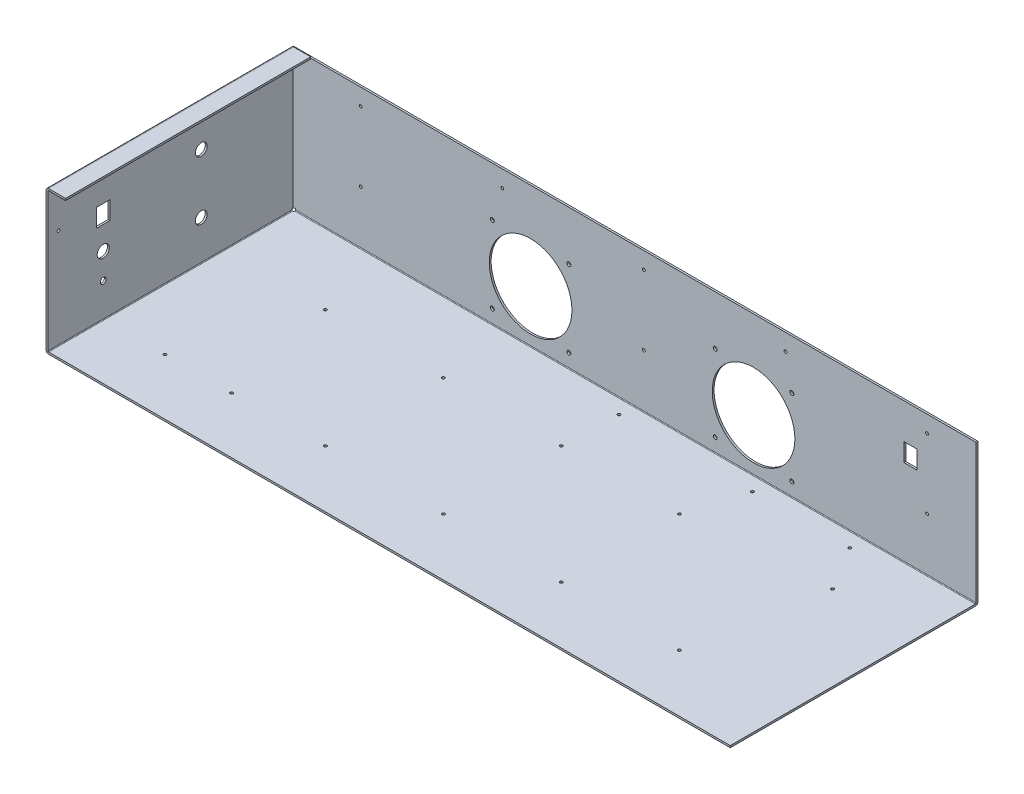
ISO-10303-21;
HEADER;
FILE_DESCRIPTION(('STEP AP214'),'2;1');
FILE_NAME('part.step','',(''),(''),'','','');
FILE_SCHEMA(('AUTOMOTIVE_DESIGN { 1 0 10303 214 1 1 1 1 }'));
ENDSEC;
DATA;
#1=APPLICATION_CONTEXT('core data for automotive mechanical design processes');
#2=APPLICATION_PROTOCOL_DEFINITION('international standard','automotive_design',2000,#1);
#3=PRODUCT_CONTEXT('',#1,'mechanical');
#4=PRODUCT('Part','Part','',(#3));
#5=PRODUCT_RELATED_PRODUCT_CATEGORY('part','',(#4));
#6=PRODUCT_DEFINITION_FORMATION('','',#4);
#7=PRODUCT_DEFINITION_CONTEXT('part definition',#1,'design');
#8=PRODUCT_DEFINITION('design','',#6,#7);
#9=PRODUCT_DEFINITION_SHAPE('','',#8);
#10=(LENGTH_UNIT() NAMED_UNIT(*) SI_UNIT(.MILLI.,.METRE.));
#11=(NAMED_UNIT(*) PLANE_ANGLE_UNIT() SI_UNIT($,.RADIAN.));
#12=(NAMED_UNIT(*) SI_UNIT($,.STERADIAN.) SOLID_ANGLE_UNIT());
#13=UNCERTAINTY_MEASURE_WITH_UNIT(LENGTH_MEASURE(1.E-05),#10,'distance_accuracy_value','');
#14=(GEOMETRIC_REPRESENTATION_CONTEXT(3) GLOBAL_UNCERTAINTY_ASSIGNED_CONTEXT((#13)) GLOBAL_UNIT_ASSIGNED_CONTEXT((#10,
#11,#12)) REPRESENTATION_CONTEXT('',''));
#15=CARTESIAN_POINT('',(0.,0.,0.));
#16=DIRECTION('',(0.,0.,1.));
#17=DIRECTION('',(1.,0.,0.));
#18=AXIS2_PLACEMENT_3D('',#15,#16,#17);
#19=CARTESIAN_POINT('',(0.,0.,29.2200000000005));
#20=DIRECTION('',(0.,0.,1.));
#21=DIRECTION('',(1.,0.,0.));
#22=AXIS2_PLACEMENT_3D('',#19,#20,#21);
#23=PLANE('',#22);
#24=DIRECTION('',(0.,-1.,0.));
#25=VECTOR('',#24,1.);
#26=CARTESIAN_POINT('',(355.6,0.,29.2200000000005));
#27=LINE('',#26,#25);
#28=CARTESIAN_POINT('',(355.6,2.032,29.2200000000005));
#29=VERTEX_POINT('',#28);
#30=CARTESIAN_POINT('',(355.6,0.,29.2200000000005));
#31=VERTEX_POINT('',#30);
#32=EDGE_CURVE('E95',#29,#31,#27,.T.);
#33=ORIENTED_EDGE('',*,*,#32,.F.);
#34=DIRECTION('',(1.,0.,0.));
#35=VECTOR('',#34,1.);
#36=CARTESIAN_POINT('',(-381.,2.032,29.2200000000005));
#37=LINE('',#36,#35);
#38=CARTESIAN_POINT('',(-378.2314,2.03200000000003,29.2200000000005));
#39=VERTEX_POINT('',#38);
#40=EDGE_CURVE('E103',#39,#29,#37,.T.);
#41=ORIENTED_EDGE('',*,*,#40,.F.);
#42=CARTESIAN_POINT('',(-378.2314,2.76860000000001,29.2200000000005));
#43=DIRECTION('',(0.,0.,1.));
#44=DIRECTION('',(1.,0.,0.));
#45=AXIS2_PLACEMENT_3D('',#42,#43,#44);
#46=CIRCLE('',#45,0.736599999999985);
#47=CARTESIAN_POINT('',(-378.968,2.76860000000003,29.2200000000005));
#48=VERTEX_POINT('',#47);
#49=EDGE_CURVE('E314',#39,#48,#46,.F.);
#50=ORIENTED_EDGE('',*,*,#49,.T.);
#51=DIRECTION('',(0.,-1.,0.));
#52=VECTOR('',#51,1.);
#53=CARTESIAN_POINT('',(-378.968,152.4,29.2200000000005));
#54=LINE('',#53,#52);
#55=CARTESIAN_POINT('',(-378.968,151.6634,29.2200000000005));
#56=VERTEX_POINT('',#55);
#57=EDGE_CURVE('E309',#56,#48,#54,.T.);
#58=ORIENTED_EDGE('',*,*,#57,.F.);
#59=CARTESIAN_POINT('',(-378.2314,151.6634,29.2200000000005));
#60=DIRECTION('',(0.,0.,1.));
#61=DIRECTION('',(1.,0.,0.));
#62=AXIS2_PLACEMENT_3D('',#59,#60,#61);
#63=CIRCLE('',#62,0.736600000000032);
#64=CARTESIAN_POINT('',(-378.2314,152.4,29.2200000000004));
#65=VERTEX_POINT('',#64);
#66=EDGE_CURVE('E295',#56,#65,#63,.F.);
#67=ORIENTED_EDGE('',*,*,#66,.T.);
#68=DIRECTION('',(-1.,0.,0.));
#69=VECTOR('',#68,1.);
#70=CARTESIAN_POINT('',(-378.968,152.4,29.2200000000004));
#71=LINE('',#70,#69);
#72=CARTESIAN_POINT('',(-359.918,152.4,29.2200000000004));
#73=VERTEX_POINT('',#72);
#74=EDGE_CURVE('E296',#73,#65,#71,.T.);
#75=ORIENTED_EDGE('',*,*,#74,.F.);
#76=DIRECTION('',(0.,1.,0.));
#77=VECTOR('',#76,1.);
#78=CARTESIAN_POINT('',(-359.918,154.432,29.2200000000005));
#79=LINE('',#78,#77);
#80=CARTESIAN_POINT('',(-359.918,154.432,29.2200000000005));
#81=VERTEX_POINT('',#80);
#82=EDGE_CURVE('E15',#73,#81,#79,.T.);
#83=ORIENTED_EDGE('',*,*,#82,.T.);
#84=DIRECTION('',(-1.,0.,0.));
#85=VECTOR('',#84,1.);
#86=CARTESIAN_POINT('',(-378.968,154.432,29.2200000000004));
#87=LINE('',#86,#85);
#88=CARTESIAN_POINT('',(-378.2314,154.432,29.2200000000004));
#89=VERTEX_POINT('',#88);
#90=EDGE_CURVE('E290',#81,#89,#87,.T.);
#91=ORIENTED_EDGE('',*,*,#90,.T.);
#92=CARTESIAN_POINT('',(-378.2314,151.6634,29.2200000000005));
#93=DIRECTION('',(0.,0.,1.));
#94=DIRECTION('',(1.,0.,0.));
#95=AXIS2_PLACEMENT_3D('',#92,#93,#94);
#96=CIRCLE('',#95,2.76860000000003);
#97=CARTESIAN_POINT('',(-381.,151.6634,29.2200000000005));
#98=VERTEX_POINT('',#97);
#99=EDGE_CURVE('E307',#98,#89,#96,.F.);
#100=ORIENTED_EDGE('',*,*,#99,.F.);
#101=DIRECTION('',(0.,-1.,0.));
#102=VECTOR('',#101,1.);
#103=CARTESIAN_POINT('',(-381.,152.4,29.2200000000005));
#104=LINE('',#103,#102);
#105=CARTESIAN_POINT('',(-381.,2.76860000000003,29.2200000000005));
#106=VERTEX_POINT('',#105);
#107=EDGE_CURVE('E311',#98,#106,#104,.T.);
#108=ORIENTED_EDGE('',*,*,#107,.T.);
#109=CARTESIAN_POINT('',(-378.2314,2.76860000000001,29.2200000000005));
#110=DIRECTION('',(0.,0.,1.));
#111=DIRECTION('',(1.,0.,0.));
#112=AXIS2_PLACEMENT_3D('',#109,#110,#111);
#113=CIRCLE('',#112,2.76859999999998);
#114=CARTESIAN_POINT('',(-378.2314,0.,29.2200000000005));
#115=VERTEX_POINT('',#114);
#116=EDGE_CURVE('E317',#115,#106,#113,.F.);
#117=ORIENTED_EDGE('',*,*,#116,.F.);
#118=DIRECTION('',(1.,0.,0.));
#119=VECTOR('',#118,1.);
#120=CARTESIAN_POINT('',(-381.,0.,29.2200000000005));
#121=LINE('',#120,#119);
#122=EDGE_CURVE('E320',#115,#31,#121,.T.);
#123=ORIENTED_EDGE('',*,*,#122,.T.);
#124=EDGE_LOOP('',(#33,#41,#50,#58,#67,#75,#83,#91,#100,#108,#117,#123));
#125=FACE_BOUND('',#124,.T.);
#126=ADVANCED_FACE('F80',(#125),#23,.T.);
#127=CARTESIAN_POINT('',(355.6,0.,0.));
#128=DIRECTION('',(1.,0.,0.));
#129=DIRECTION('',(0.,0.,-1.));
#130=AXIS2_PLACEMENT_3D('',#127,#128,#129);
#131=PLANE('',#130);
#132=DIRECTION('',(0.,0.,-1.));
#133=VECTOR('',#132,1.);
#134=CARTESIAN_POINT('',(355.6,2.032,237.5));
#135=LINE('',#134,#133);
#136=CARTESIAN_POINT('',(355.6,2.03200000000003,-234.7314));
#137=VERTEX_POINT('',#136);
#138=EDGE_CURVE('E324',#29,#137,#135,.T.);
#139=ORIENTED_EDGE('',*,*,#138,.F.);
#140=ORIENTED_EDGE('',*,*,#32,.T.);
#141=DIRECTION('',(0.,0.,-1.));
#142=VECTOR('',#141,1.);
#143=CARTESIAN_POINT('',(355.6,0.,237.5));
#144=LINE('',#143,#142);
#145=CARTESIAN_POINT('',(355.6,0.,-234.7314));
#146=VERTEX_POINT('',#145);
#147=EDGE_CURVE('E326',#31,#146,#144,.T.);
#148=ORIENTED_EDGE('',*,*,#147,.T.);
#149=CARTESIAN_POINT('',(355.6,2.76860000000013,-234.7314));
#150=DIRECTION('',(1.,0.,0.));
#151=DIRECTION('',(0.,0.,-1.));
#152=AXIS2_PLACEMENT_3D('',#149,#150,#151);
#153=CIRCLE('',#152,2.7686);
#154=CARTESIAN_POINT('',(355.6,2.76860000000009,-237.5));
#155=VERTEX_POINT('',#154);
#156=EDGE_CURVE('E331',#155,#146,#153,.F.);
#157=ORIENTED_EDGE('',*,*,#156,.F.);
#158=DIRECTION('',(0.,1.,0.));
#159=VECTOR('',#158,1.);
#160=CARTESIAN_POINT('',(355.6,152.4,-237.5));
#161=LINE('',#160,#159);
#162=CARTESIAN_POINT('',(355.6,152.4,-237.5));
#163=VERTEX_POINT('',#162);
#164=EDGE_CURVE('E336',#155,#163,#161,.T.);
#165=ORIENTED_EDGE('',*,*,#164,.T.);
#166=DIRECTION('',(0.,0.,1.));
#167=VECTOR('',#166,1.);
#168=CARTESIAN_POINT('',(355.6,152.4,1317.63670460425));
#169=LINE('',#168,#167);
#170=CARTESIAN_POINT('',(355.6,152.4,-235.468));
#171=VERTEX_POINT('',#170);
#172=EDGE_CURVE('E339',#163,#171,#169,.T.);
#173=ORIENTED_EDGE('',*,*,#172,.T.);
#174=DIRECTION('',(0.,1.,0.));
#175=VECTOR('',#174,1.);
#176=CARTESIAN_POINT('',(355.6,152.4,-235.468));
#177=LINE('',#176,#175);
#178=CARTESIAN_POINT('',(355.6,2.76860000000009,-235.468));
#179=VERTEX_POINT('',#178);
#180=EDGE_CURVE('E334',#179,#171,#177,.T.);
#181=ORIENTED_EDGE('',*,*,#180,.F.);
#182=CARTESIAN_POINT('',(355.6,2.76860000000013,-234.7314));
#183=DIRECTION('',(1.,0.,0.));
#184=DIRECTION('',(0.,0.,-1.));
#185=AXIS2_PLACEMENT_3D('',#182,#183,#184);
#186=CIRCLE('',#185,0.736599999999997);
#187=EDGE_CURVE('E328',#179,#137,#186,.F.);
#188=ORIENTED_EDGE('',*,*,#187,.T.);
#189=EDGE_LOOP('',(#139,#140,#148,#157,#165,#173,#181,#188));
#190=FACE_BOUND('',#189,.T.);
#191=ADVANCED_FACE('F807',(#190),#131,.T.);
#192=CARTESIAN_POINT('',(-381.,0.,237.5));
#193=DIRECTION('',(0.,1.,0.));
#194=DIRECTION('',(0.,0.,1.));
#195=AXIS2_PLACEMENT_3D('',#192,#193,#194);
#196=PLANE('',#195);
#197=CARTESIAN_POINT('',(235.625561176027,-8.07904090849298E-11,-219.483913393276));
#198=DIRECTION('',(0.,1.,0.));
#199=DIRECTION('',(0.,0.,1.));
#200=AXIS2_PLACEMENT_3D('',#197,#198,#199);
#201=CIRCLE('',#200,1.52399999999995);
#202=CARTESIAN_POINT('',(235.625561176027,-8.07904090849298E-11,-217.959913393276));
#203=VERTEX_POINT('',#202);
#204=EDGE_CURVE('E375',#203,#203,#201,.T.);
#205=ORIENTED_EDGE('',*,*,#204,.T.);
#206=EDGE_LOOP('',(#205));
#207=FACE_BOUND('',#206,.T.);
#208=CARTESIAN_POINT('',(130.843947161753,-8.07904090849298E-11,-219.483913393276));
#209=DIRECTION('',(0.,1.,0.));
#210=DIRECTION('',(0.,0.,1.));
#211=AXIS2_PLACEMENT_3D('',#208,#209,#210);
#212=CIRCLE('',#211,1.52400000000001);
#213=CARTESIAN_POINT('',(130.843947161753,-8.07904090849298E-11,-217.959913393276));
#214=VERTEX_POINT('',#213);
#215=EDGE_CURVE('E381',#214,#214,#212,.T.);
#216=ORIENTED_EDGE('',*,*,#215,.T.);
#217=EDGE_LOOP('',(#216));
#218=FACE_BOUND('',#217,.T.);
#219=CARTESIAN_POINT('',(-12.8622538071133,-8.07904090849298E-11,-219.483913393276));
#220=DIRECTION('',(0.,1.,0.));
#221=DIRECTION('',(0.,0.,1.));
#222=AXIS2_PLACEMENT_3D('',#219,#220,#221);
#223=CIRCLE('',#222,1.52400000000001);
#224=CARTESIAN_POINT('',(-12.8622538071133,-8.07904090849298E-11,-217.959913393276));
#225=VERTEX_POINT('',#224);
#226=EDGE_CURVE('E387',#225,#225,#223,.T.);
#227=ORIENTED_EDGE('',*,*,#226,.T.);
#228=EDGE_LOOP('',(#227));
#229=FACE_BOUND('',#228,.T.);
#230=CARTESIAN_POINT('',(-313.314162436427,-1.8492932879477E-10,-31.0894560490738));
#231=DIRECTION('',(0.,1.,0.));
#232=DIRECTION('',(0.,0.,1.));
#233=AXIS2_PLACEMENT_3D('',#230,#231,#232);
#234=CIRCLE('',#233,1.58750000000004);
#235=CARTESIAN_POINT('',(-313.314162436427,-1.8492932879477E-10,-29.5019560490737));
#236=VERTEX_POINT('',#235);
#237=EDGE_CURVE('E393',#236,#236,#234,.T.);
#238=ORIENTED_EDGE('',*,*,#237,.T.);
#239=EDGE_LOOP('',(#238));
#240=FACE_BOUND('',#239,.T.);
#241=CARTESIAN_POINT('',(-241.484181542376,-1.8492932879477E-10,-31.0894560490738));
#242=DIRECTION('',(0.,1.,0.));
#243=DIRECTION('',(0.,0.,1.));
#244=AXIS2_PLACEMENT_3D('',#241,#242,#243);
#245=CIRCLE('',#244,1.58750000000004);
#246=CARTESIAN_POINT('',(-241.484181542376,-1.8492932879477E-10,-29.5019560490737));
#247=VERTEX_POINT('',#246);
#248=EDGE_CURVE('E399',#247,#247,#245,.T.);
#249=ORIENTED_EDGE('',*,*,#248,.T.);
#250=EDGE_LOOP('',(#249));
#251=FACE_BOUND('',#250,.T.);
#252=CARTESIAN_POINT('',(-141.732,0.,-32.268));
#253=DIRECTION('',(0.,1.,0.));
#254=DIRECTION('',(0.,0.,1.));
#255=AXIS2_PLACEMENT_3D('',#252,#253,#254);
#256=CIRCLE('',#255,1.52400000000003);
#257=CARTESIAN_POINT('',(-141.732,0.,-30.744));
#258=VERTEX_POINT('',#257);
#259=EDGE_CURVE('E579',#258,#258,#256,.F.);
#260=ORIENTED_EDGE('',*,*,#259,.F.);
#261=EDGE_LOOP('',(#260));
#262=FACE_BOUND('',#261,.T.);
#263=CARTESIAN_POINT('',(-14.7319999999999,0.,-32.2680000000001));
#264=DIRECTION('',(0.,1.,0.));
#265=DIRECTION('',(0.,0.,1.));
#266=AXIS2_PLACEMENT_3D('',#263,#264,#265);
#267=CIRCLE('',#266,1.52400000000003);
#268=CARTESIAN_POINT('',(-14.7319999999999,0.,-30.744));
#269=VERTEX_POINT('',#268);
#270=EDGE_CURVE('E582',#269,#269,#267,.F.);
#271=ORIENTED_EDGE('',*,*,#270,.F.);
#272=EDGE_LOOP('',(#271));
#273=FACE_BOUND('',#272,.T.);
#274=CARTESIAN_POINT('',(112.268,0.,-32.2680000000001));
#275=DIRECTION('',(0.,1.,0.));
#276=DIRECTION('',(0.,0.,1.));
#277=AXIS2_PLACEMENT_3D('',#274,#275,#276);
#278=CIRCLE('',#277,1.52400000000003);
#279=CARTESIAN_POINT('',(112.268,0.,-30.7440000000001));
#280=VERTEX_POINT('',#279);
#281=EDGE_CURVE('E585',#280,#280,#278,.F.);
#282=ORIENTED_EDGE('',*,*,#281,.F.);
#283=EDGE_LOOP('',(#282));
#284=FACE_BOUND('',#283,.T.);
#285=CARTESIAN_POINT('',(239.268,0.,-32.2680000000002));
#286=DIRECTION('',(0.,1.,0.));
#287=DIRECTION('',(0.,0.,1.));
#288=AXIS2_PLACEMENT_3D('',#285,#286,#287);
#289=CIRCLE('',#288,1.52400000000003);
#290=CARTESIAN_POINT('',(239.268,0.,-30.7440000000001));
#291=VERTEX_POINT('',#290);
#292=EDGE_CURVE('E588',#291,#291,#289,.F.);
#293=ORIENTED_EDGE('',*,*,#292,.F.);
#294=EDGE_LOOP('',(#293));
#295=FACE_BOUND('',#294,.T.);
#296=CARTESIAN_POINT('',(-268.732,0.,-159.268));
#297=DIRECTION('',(0.,1.,0.));
#298=DIRECTION('',(0.,0.,1.));
#299=AXIS2_PLACEMENT_3D('',#296,#297,#298);
#300=CIRCLE('',#299,1.52400000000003);
#301=CARTESIAN_POINT('',(-268.732,0.,-157.744));
#302=VERTEX_POINT('',#301);
#303=EDGE_CURVE('E591',#302,#302,#300,.F.);
#304=ORIENTED_EDGE('',*,*,#303,.F.);
#305=EDGE_LOOP('',(#304));
#306=FACE_BOUND('',#305,.T.);
#307=CARTESIAN_POINT('',(-141.732,0.,-159.268));
#308=DIRECTION('',(0.,1.,0.));
#309=DIRECTION('',(0.,0.,1.));
#310=AXIS2_PLACEMENT_3D('',#307,#308,#309);
#311=CIRCLE('',#310,1.52400000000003);
#312=CARTESIAN_POINT('',(-141.732,0.,-157.744));
#313=VERTEX_POINT('',#312);
#314=EDGE_CURVE('E594',#313,#313,#311,.F.);
#315=ORIENTED_EDGE('',*,*,#314,.F.);
#316=EDGE_LOOP('',(#315));
#317=FACE_BOUND('',#316,.T.);
#318=CARTESIAN_POINT('',(-14.7319999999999,0.,-159.268));
#319=DIRECTION('',(0.,1.,0.));
#320=DIRECTION('',(0.,0.,1.));
#321=AXIS2_PLACEMENT_3D('',#318,#319,#320);
#322=CIRCLE('',#321,1.52400000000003);
#323=CARTESIAN_POINT('',(-14.7319999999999,0.,-157.744));
#324=VERTEX_POINT('',#323);
#325=EDGE_CURVE('E597',#324,#324,#322,.F.);
#326=ORIENTED_EDGE('',*,*,#325,.F.);
#327=EDGE_LOOP('',(#326));
#328=FACE_BOUND('',#327,.T.);
#329=CARTESIAN_POINT('',(112.268,0.,-159.268));
#330=DIRECTION('',(0.,1.,0.));
#331=DIRECTION('',(0.,0.,1.));
#332=AXIS2_PLACEMENT_3D('',#329,#330,#331);
#333=CIRCLE('',#332,1.52400000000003);
#334=CARTESIAN_POINT('',(112.268,0.,-157.744));
#335=VERTEX_POINT('',#334);
#336=EDGE_CURVE('E600',#335,#335,#333,.F.);
#337=ORIENTED_EDGE('',*,*,#336,.F.);
#338=EDGE_LOOP('',(#337));
#339=FACE_BOUND('',#338,.T.);
#340=CARTESIAN_POINT('',(264.668,0.,-171.968));
#341=DIRECTION('',(0.,1.,0.));
#342=DIRECTION('',(0.,0.,1.));
#343=AXIS2_PLACEMENT_3D('',#340,#341,#342);
#344=CIRCLE('',#343,1.52400000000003);
#345=CARTESIAN_POINT('',(264.668,0.,-170.444));
#346=VERTEX_POINT('',#345);
#347=EDGE_CURVE('E603',#346,#346,#344,.F.);
#348=ORIENTED_EDGE('',*,*,#347,.F.);
#349=EDGE_LOOP('',(#348));
#350=FACE_BOUND('',#349,.T.);
#351=ORIENTED_EDGE('',*,*,#122,.F.);
#352=DIRECTION('',(0.,0.,1.));
#353=VECTOR('',#352,1.);
#354=CARTESIAN_POINT('',(-378.2314,0.,-233.7154));
#355=LINE('',#354,#353);
#356=CARTESIAN_POINT('',(-378.2314,0.,-233.7154));
#357=VERTEX_POINT('',#356);
#358=EDGE_CURVE('E613',#357,#115,#355,.T.);
#359=ORIENTED_EDGE('',*,*,#358,.F.);
#360=DIRECTION('',(-1.,0.,0.));
#361=VECTOR('',#360,1.);
#362=CARTESIAN_POINT('',(-381.,0.,-233.7154));
#363=LINE('',#362,#361);
#364=CARTESIAN_POINT('',(-377.2154,0.,-233.7154));
#365=VERTEX_POINT('',#364);
#366=EDGE_CURVE('E604',#365,#357,#363,.T.);
#367=ORIENTED_EDGE('',*,*,#366,.F.);
#368=DIRECTION('',(0.,0.,1.));
#369=VECTOR('',#368,1.);
#370=CARTESIAN_POINT('',(-377.2154,0.,237.5));
#371=LINE('',#370,#369);
#372=CARTESIAN_POINT('',(-377.2154,0.,-234.7314));
#373=VERTEX_POINT('',#372);
#374=EDGE_CURVE('E627',#373,#365,#371,.T.);
#375=ORIENTED_EDGE('',*,*,#374,.F.);
#376=DIRECTION('',(-1.,0.,0.));
#377=VECTOR('',#376,1.);
#378=CARTESIAN_POINT('',(377.2154,0.,-234.7314));
#379=LINE('',#378,#377);
#380=EDGE_CURVE('E611',#146,#373,#379,.T.);
#381=ORIENTED_EDGE('',*,*,#380,.F.);
#382=ORIENTED_EDGE('',*,*,#147,.F.);
#383=EDGE_LOOP('',(#351,#359,#367,#375,#381,#382));
#384=FACE_BOUND('',#383,.T.);
#385=ADVANCED_FACE('F764',(#207,#218,#229,#240,#251,#262,#273,#284,#295,#306,#317,#328,#339,
#350,#384),#196,.F.);
#386=CARTESIAN_POINT('',(-381.,2.032,237.5));
#387=DIRECTION('',(0.,1.,0.));
#388=DIRECTION('',(0.,0.,1.));
#389=AXIS2_PLACEMENT_3D('',#386,#387,#388);
#390=PLANE('',#389);
#391=CARTESIAN_POINT('',(235.625561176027,2.03199999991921,-219.483913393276));
#392=DIRECTION('',(0.,1.,0.));
#393=DIRECTION('',(0.,0.,1.));
#394=AXIS2_PLACEMENT_3D('',#391,#392,#393);
#395=CIRCLE('',#394,1.52399999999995);
#396=CARTESIAN_POINT('',(235.625561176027,2.03199999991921,-217.959913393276));
#397=VERTEX_POINT('',#396);
#398=EDGE_CURVE('E368',#397,#397,#395,.T.);
#399=ORIENTED_EDGE('',*,*,#398,.F.);
#400=EDGE_LOOP('',(#399));
#401=FACE_BOUND('',#400,.T.);
#402=CARTESIAN_POINT('',(130.843947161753,2.03199999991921,-219.483913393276));
#403=DIRECTION('',(0.,1.,0.));
#404=DIRECTION('',(0.,0.,1.));
#405=AXIS2_PLACEMENT_3D('',#402,#403,#404);
#406=CIRCLE('',#405,1.52400000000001);
#407=CARTESIAN_POINT('',(130.843947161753,2.03199999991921,-217.959913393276));
#408=VERTEX_POINT('',#407);
#409=EDGE_CURVE('E378',#408,#408,#406,.T.);
#410=ORIENTED_EDGE('',*,*,#409,.F.);
#411=EDGE_LOOP('',(#410));
#412=FACE_BOUND('',#411,.T.);
#413=CARTESIAN_POINT('',(-12.8622538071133,2.03199999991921,-219.483913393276));
#414=DIRECTION('',(0.,1.,0.));
#415=DIRECTION('',(0.,0.,1.));
#416=AXIS2_PLACEMENT_3D('',#413,#414,#415);
#417=CIRCLE('',#416,1.52400000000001);
#418=CARTESIAN_POINT('',(-12.8622538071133,2.03199999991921,-217.959913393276));
#419=VERTEX_POINT('',#418);
#420=EDGE_CURVE('E384',#419,#419,#417,.T.);
#421=ORIENTED_EDGE('',*,*,#420,.F.);
#422=EDGE_LOOP('',(#421));
#423=FACE_BOUND('',#422,.T.);
#424=CARTESIAN_POINT('',(-313.314162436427,2.032,-31.0894560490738));
#425=DIRECTION('',(0.,1.,0.));
#426=DIRECTION('',(0.,0.,1.));
#427=AXIS2_PLACEMENT_3D('',#424,#425,#426);
#428=CIRCLE('',#427,1.58750000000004);
#429=CARTESIAN_POINT('',(-313.314162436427,2.032,-29.5019560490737));
#430=VERTEX_POINT('',#429);
#431=EDGE_CURVE('E390',#430,#430,#428,.T.);
#432=ORIENTED_EDGE('',*,*,#431,.F.);
#433=EDGE_LOOP('',(#432));
#434=FACE_BOUND('',#433,.T.);
#435=CARTESIAN_POINT('',(-241.484181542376,2.032,-31.0894560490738));
#436=DIRECTION('',(0.,1.,0.));
#437=DIRECTION('',(0.,0.,1.));
#438=AXIS2_PLACEMENT_3D('',#435,#436,#437);
#439=CIRCLE('',#438,1.58750000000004);
#440=CARTESIAN_POINT('',(-241.484181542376,2.032,-29.5019560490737));
#441=VERTEX_POINT('',#440);
#442=EDGE_CURVE('E396',#441,#441,#439,.T.);
#443=ORIENTED_EDGE('',*,*,#442,.F.);
#444=EDGE_LOOP('',(#443));
#445=FACE_BOUND('',#444,.T.);
#446=CARTESIAN_POINT('',(-141.732,2.032,-32.268));
#447=DIRECTION('',(0.,1.,0.));
#448=DIRECTION('',(0.,0.,1.));
#449=AXIS2_PLACEMENT_3D('',#446,#447,#448);
#450=CIRCLE('',#449,1.52400000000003);
#451=CARTESIAN_POINT('',(-141.732,2.032,-30.744));
#452=VERTEX_POINT('',#451);
#453=EDGE_CURVE('E550',#452,#452,#450,.T.);
#454=ORIENTED_EDGE('',*,*,#453,.F.);
#455=EDGE_LOOP('',(#454));
#456=FACE_BOUND('',#455,.T.);
#457=CARTESIAN_POINT('',(-14.7319999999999,2.032,-32.2680000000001));
#458=DIRECTION('',(0.,1.,0.));
#459=DIRECTION('',(0.,0.,1.));
#460=AXIS2_PLACEMENT_3D('',#457,#458,#459);
#461=CIRCLE('',#460,1.52400000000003);
#462=CARTESIAN_POINT('',(-14.7319999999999,2.032,-30.744));
#463=VERTEX_POINT('',#462);
#464=EDGE_CURVE('E554',#463,#463,#461,.T.);
#465=ORIENTED_EDGE('',*,*,#464,.F.);
#466=EDGE_LOOP('',(#465));
#467=FACE_BOUND('',#466,.T.);
#468=CARTESIAN_POINT('',(112.268,2.032,-32.2680000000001));
#469=DIRECTION('',(0.,1.,0.));
#470=DIRECTION('',(0.,0.,1.));
#471=AXIS2_PLACEMENT_3D('',#468,#469,#470);
#472=CIRCLE('',#471,1.52400000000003);
#473=CARTESIAN_POINT('',(112.268,2.032,-30.7440000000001));
#474=VERTEX_POINT('',#473);
#475=EDGE_CURVE('E557',#474,#474,#472,.T.);
#476=ORIENTED_EDGE('',*,*,#475,.F.);
#477=EDGE_LOOP('',(#476));
#478=FACE_BOUND('',#477,.T.);
#479=CARTESIAN_POINT('',(239.268,2.032,-32.2680000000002));
#480=DIRECTION('',(0.,1.,0.));
#481=DIRECTION('',(0.,0.,1.));
#482=AXIS2_PLACEMENT_3D('',#479,#480,#481);
#483=CIRCLE('',#482,1.52400000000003);
#484=CARTESIAN_POINT('',(239.268,2.032,-30.7440000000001));
#485=VERTEX_POINT('',#484);
#486=EDGE_CURVE('E560',#485,#485,#483,.T.);
#487=ORIENTED_EDGE('',*,*,#486,.F.);
#488=EDGE_LOOP('',(#487));
#489=FACE_BOUND('',#488,.T.);
#490=CARTESIAN_POINT('',(-268.732,2.032,-159.268));
#491=DIRECTION('',(0.,1.,0.));
#492=DIRECTION('',(0.,0.,1.));
#493=AXIS2_PLACEMENT_3D('',#490,#491,#492);
#494=CIRCLE('',#493,1.52400000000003);
#495=CARTESIAN_POINT('',(-268.732,2.032,-157.744));
#496=VERTEX_POINT('',#495);
#497=EDGE_CURVE('E563',#496,#496,#494,.T.);
#498=ORIENTED_EDGE('',*,*,#497,.F.);
#499=EDGE_LOOP('',(#498));
#500=FACE_BOUND('',#499,.T.);
#501=CARTESIAN_POINT('',(-141.732,2.032,-159.268));
#502=DIRECTION('',(0.,1.,0.));
#503=DIRECTION('',(0.,0.,1.));
#504=AXIS2_PLACEMENT_3D('',#501,#502,#503);
#505=CIRCLE('',#504,1.52400000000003);
#506=CARTESIAN_POINT('',(-141.732,2.032,-157.744));
#507=VERTEX_POINT('',#506);
#508=EDGE_CURVE('E566',#507,#507,#505,.T.);
#509=ORIENTED_EDGE('',*,*,#508,.F.);
#510=EDGE_LOOP('',(#509));
#511=FACE_BOUND('',#510,.T.);
#512=CARTESIAN_POINT('',(-14.7319999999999,2.032,-159.268));
#513=DIRECTION('',(0.,1.,0.));
#514=DIRECTION('',(0.,0.,1.));
#515=AXIS2_PLACEMENT_3D('',#512,#513,#514);
#516=CIRCLE('',#515,1.52400000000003);
#517=CARTESIAN_POINT('',(-14.7319999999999,2.032,-157.744));
#518=VERTEX_POINT('',#517);
#519=EDGE_CURVE('E569',#518,#518,#516,.T.);
#520=ORIENTED_EDGE('',*,*,#519,.F.);
#521=EDGE_LOOP('',(#520));
#522=FACE_BOUND('',#521,.T.);
#523=CARTESIAN_POINT('',(112.268,2.032,-159.268));
#524=DIRECTION('',(0.,1.,0.));
#525=DIRECTION('',(0.,0.,1.));
#526=AXIS2_PLACEMENT_3D('',#523,#524,#525);
#527=CIRCLE('',#526,1.52400000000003);
#528=CARTESIAN_POINT('',(112.268,2.032,-157.744));
#529=VERTEX_POINT('',#528);
#530=EDGE_CURVE('E572',#529,#529,#527,.T.);
#531=ORIENTED_EDGE('',*,*,#530,.F.);
#532=EDGE_LOOP('',(#531));
#533=FACE_BOUND('',#532,.T.);
#534=CARTESIAN_POINT('',(264.668,2.032,-171.968));
#535=DIRECTION('',(0.,1.,0.));
#536=DIRECTION('',(0.,0.,1.));
#537=AXIS2_PLACEMENT_3D('',#534,#535,#536);
#538=CIRCLE('',#537,1.52400000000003);
#539=CARTESIAN_POINT('',(264.668,2.032,-170.444));
#540=VERTEX_POINT('',#539);
#541=EDGE_CURVE('E575',#540,#540,#538,.T.);
#542=ORIENTED_EDGE('',*,*,#541,.F.);
#543=EDGE_LOOP('',(#542));
#544=FACE_BOUND('',#543,.T.);
#545=DIRECTION('',(0.,0.,1.));
#546=VECTOR('',#545,1.);
#547=CARTESIAN_POINT('',(-378.2314,2.03200000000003,-233.7154));
#548=LINE('',#547,#546);
#549=CARTESIAN_POINT('',(-378.2314,2.03200000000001,-233.7154));
#550=VERTEX_POINT('',#549);
#551=EDGE_CURVE('E609',#550,#39,#548,.T.);
#552=ORIENTED_EDGE('',*,*,#551,.T.);
#553=ORIENTED_EDGE('',*,*,#40,.T.);
#554=ORIENTED_EDGE('',*,*,#138,.T.);
#555=DIRECTION('',(-1.,0.,0.));
#556=VECTOR('',#555,1.);
#557=CARTESIAN_POINT('',(377.2154,2.03200000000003,-234.7314));
#558=LINE('',#557,#556);
#559=CARTESIAN_POINT('',(-377.2154,2.03200000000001,-234.7314));
#560=VERTEX_POINT('',#559);
#561=EDGE_CURVE('E607',#137,#560,#558,.T.);
#562=ORIENTED_EDGE('',*,*,#561,.T.);
#563=DIRECTION('',(0.,0.,1.));
#564=VECTOR('',#563,1.);
#565=CARTESIAN_POINT('',(-377.2154,2.03200000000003,237.5));
#566=LINE('',#565,#564);
#567=CARTESIAN_POINT('',(-377.2154,2.032,-233.7154));
#568=VERTEX_POINT('',#567);
#569=EDGE_CURVE('E624',#560,#568,#566,.T.);
#570=ORIENTED_EDGE('',*,*,#569,.T.);
#571=DIRECTION('',(-1.,0.,0.));
#572=VECTOR('',#571,1.);
#573=CARTESIAN_POINT('',(-381.,2.032,-233.7154));
#574=LINE('',#573,#572);
#575=EDGE_CURVE('E576',#568,#550,#574,.T.);
#576=ORIENTED_EDGE('',*,*,#575,.T.);
#577=EDGE_LOOP('',(#552,#553,#554,#562,#570,#576));
#578=FACE_BOUND('',#577,.T.);
#579=ADVANCED_FACE('F761',(#401,#412,#423,#434,#445,#456,#467,#478,#489,#500,#511,#522,#533,
#544,#578),#390,.T.);
#580=CARTESIAN_POINT('',(-381.,152.4,-237.5));
#581=DIRECTION('',(1.,0.,0.));
#582=DIRECTION('',(0.,0.,-1.));
#583=AXIS2_PLACEMENT_3D('',#580,#581,#582);
#584=PLANE('',#583);
#585=CARTESIAN_POINT('',(-381.,44.45,-135.9));
#586=DIRECTION('',(-1.,0.,0.));
#587=DIRECTION('',(0.,0.,1.));
#588=AXIS2_PLACEMENT_3D('',#585,#586,#587);
#589=CIRCLE('',#588,6.34999999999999);
#590=CARTESIAN_POINT('',(-381.,44.45,-129.55));
#591=VERTEX_POINT('',#590);
#592=EDGE_CURVE('E654',#591,#591,#589,.T.);
#593=ORIENTED_EDGE('',*,*,#592,.F.);
#594=EDGE_LOOP('',(#593));
#595=FACE_BOUND('',#594,.T.);
#596=CARTESIAN_POINT('',(-381.,107.95,-135.9));
#597=DIRECTION('',(-1.,0.,0.));
#598=DIRECTION('',(0.,0.,1.));
#599=AXIS2_PLACEMENT_3D('',#596,#597,#598);
#600=CIRCLE('',#599,6.34999999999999);
#601=CARTESIAN_POINT('',(-381.,107.95,-129.55));
#602=VERTEX_POINT('',#601);
#603=EDGE_CURVE('E660',#602,#602,#600,.T.);
#604=ORIENTED_EDGE('',*,*,#603,.F.);
#605=EDGE_LOOP('',(#604));
#606=FACE_BOUND('',#605,.T.);
#607=DIRECTION('',(0.,0.,1.));
#608=VECTOR('',#607,1.);
#609=CARTESIAN_POINT('',(-381.,110.370800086,-23.2759999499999));
#610=LINE('',#609,#608);
#611=CARTESIAN_POINT('',(-381.,110.370800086,-37.4999999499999));
#612=VERTEX_POINT('',#611);
#613=CARTESIAN_POINT('',(-381.,110.370800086,-23.2759999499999));
#614=VERTEX_POINT('',#613);
#615=EDGE_CURVE('E433',#612,#614,#610,.T.);
#616=ORIENTED_EDGE('',*,*,#615,.T.);
#617=DIRECTION('',(0.,-1.,0.));
#618=VECTOR('',#617,1.);
#619=CARTESIAN_POINT('',(-381.,110.370800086,-23.2759999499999));
#620=LINE('',#619,#618);
#621=CARTESIAN_POINT('',(-381.,90.8128000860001,-23.2759999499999));
#622=VERTEX_POINT('',#621);
#623=EDGE_CURVE('E423',#614,#622,#620,.T.);
#624=ORIENTED_EDGE('',*,*,#623,.T.);
#625=DIRECTION('',(0.,0.,-1.));
#626=VECTOR('',#625,1.);
#627=CARTESIAN_POINT('',(-381.,90.8128000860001,-23.2759999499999));
#628=LINE('',#627,#626);
#629=CARTESIAN_POINT('',(-381.,90.8128000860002,-37.4999999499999));
#630=VERTEX_POINT('',#629);
#631=EDGE_CURVE('E426',#622,#630,#628,.T.);
#632=ORIENTED_EDGE('',*,*,#631,.T.);
#633=DIRECTION('',(0.,1.,0.));
#634=VECTOR('',#633,1.);
#635=CARTESIAN_POINT('',(-381.,110.370800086,-37.4999999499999));
#636=LINE('',#635,#634);
#637=EDGE_CURVE('E430',#630,#612,#636,.T.);
#638=ORIENTED_EDGE('',*,*,#637,.T.);
#639=EDGE_LOOP('',(#616,#624,#632,#638));
#640=FACE_BOUND('',#639,.T.);
#641=CARTESIAN_POINT('',(-380.999999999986,109.111159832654,17.7193417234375));
#642=DIRECTION('',(1.,0.,0.));
#643=DIRECTION('',(0.,0.,-1.));
#644=AXIS2_PLACEMENT_3D('',#641,#642,#643);
#645=CIRCLE('',#644,1.52400000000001);
#646=CARTESIAN_POINT('',(-380.999999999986,109.111159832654,16.1953417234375));
#647=VERTEX_POINT('',#646);
#648=EDGE_CURVE('E417',#647,#647,#645,.T.);
#649=ORIENTED_EDGE('',*,*,#648,.T.);
#650=EDGE_LOOP('',(#649));
#651=FACE_BOUND('',#650,.T.);
#652=CARTESIAN_POINT('',(-381.,38.2876193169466,-30.3879999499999));
#653=DIRECTION('',(-1.,0.,0.));
#654=DIRECTION('',(0.,0.,1.));
#655=AXIS2_PLACEMENT_3D('',#652,#653,#654);
#656=CIRCLE('',#655,3.175);
#657=CARTESIAN_POINT('',(-381.,38.2876193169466,-27.2129999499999));
#658=VERTEX_POINT('',#657);
#659=EDGE_CURVE('E411',#658,#658,#656,.T.);
#660=ORIENTED_EDGE('',*,*,#659,.F.);
#661=EDGE_LOOP('',(#660));
#662=FACE_BOUND('',#661,.T.);
#663=CARTESIAN_POINT('',(-381.,65.8188168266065,-30.3879999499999));
#664=DIRECTION('',(-1.,0.,0.));
#665=DIRECTION('',(0.,0.,1.));
#666=AXIS2_PLACEMENT_3D('',#663,#664,#665);
#667=CIRCLE('',#666,6.50000000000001);
#668=CARTESIAN_POINT('',(-381.,65.8188168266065,-23.8879999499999));
#669=VERTEX_POINT('',#668);
#670=EDGE_CURVE('E405',#669,#669,#667,.T.);
#671=ORIENTED_EDGE('',*,*,#670,.F.);
#672=EDGE_LOOP('',(#671));
#673=FACE_BOUND('',#672,.T.);
#674=ORIENTED_EDGE('',*,*,#107,.F.);
#675=DIRECTION('',(0.,0.,1.));
#676=VECTOR('',#675,1.);
#677=CARTESIAN_POINT('',(-381.,151.6634,234.706));
#678=LINE('',#677,#676);
#679=CARTESIAN_POINT('',(-381.,151.6634,-234.706));
#680=VERTEX_POINT('',#679);
#681=EDGE_CURVE('E528',#98,#680,#678,.F.);
#682=ORIENTED_EDGE('',*,*,#681,.T.);
#683=DIRECTION('',(0.,1.,0.));
#684=VECTOR('',#683,1.);
#685=CARTESIAN_POINT('',(-381.,2.03200000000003,-234.706));
#686=LINE('',#685,#684);
#687=CARTESIAN_POINT('',(-381.,3.78460000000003,-234.706));
#688=VERTEX_POINT('',#687);
#689=EDGE_CURVE('E666',#688,#680,#686,.T.);
#690=ORIENTED_EDGE('',*,*,#689,.F.);
#691=DIRECTION('',(0.,0.,1.));
#692=VECTOR('',#691,1.);
#693=CARTESIAN_POINT('',(-381.,3.78460000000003,-237.5));
#694=LINE('',#693,#692);
#695=CARTESIAN_POINT('',(-381.,3.78460000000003,-233.7154));
#696=VERTEX_POINT('',#695);
#697=EDGE_CURVE('E638',#688,#696,#694,.T.);
#698=ORIENTED_EDGE('',*,*,#697,.T.);
#699=DIRECTION('',(0.,1.,0.));
#700=VECTOR('',#699,1.);
#701=CARTESIAN_POINT('',(-381.,152.4,-233.7154));
#702=LINE('',#701,#700);
#703=CARTESIAN_POINT('',(-381.,2.76859999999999,-233.7154));
#704=VERTEX_POINT('',#703);
#705=EDGE_CURVE('E643',#704,#696,#702,.T.);
#706=ORIENTED_EDGE('',*,*,#705,.F.);
#707=DIRECTION('',(0.,0.,1.));
#708=VECTOR('',#707,1.);
#709=CARTESIAN_POINT('',(-381.,2.76860000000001,-233.7154));
#710=LINE('',#709,#708);
#711=EDGE_CURVE('E640',#704,#106,#710,.T.);
#712=ORIENTED_EDGE('',*,*,#711,.T.);
#713=EDGE_LOOP('',(#674,#682,#690,#698,#706,#712));
#714=FACE_BOUND('',#713,.T.);
#715=ADVANCED_FACE('F763',(#595,#606,#640,#651,#662,#673,#714),#584,.F.);
#716=CARTESIAN_POINT('',(-378.968,152.4,-237.5));
#717=DIRECTION('',(1.,0.,0.));
#718=DIRECTION('',(0.,0.,-1.));
#719=AXIS2_PLACEMENT_3D('',#716,#717,#718);
#720=PLANE('',#719);
#721=CARTESIAN_POINT('',(-378.968,107.95,-135.9));
#722=DIRECTION('',(1.,0.,0.));
#723=DIRECTION('',(0.,0.,-1.));
#724=AXIS2_PLACEMENT_3D('',#721,#722,#723);
#725=CIRCLE('',#724,6.34999999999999);
#726=CARTESIAN_POINT('',(-378.968,107.95,-142.25));
#727=VERTEX_POINT('',#726);
#728=EDGE_CURVE('E663',#727,#727,#725,.T.);
#729=ORIENTED_EDGE('',*,*,#728,.F.);
#730=EDGE_LOOP('',(#729));
#731=FACE_BOUND('',#730,.T.);
#732=CARTESIAN_POINT('',(-378.968,44.45,-135.9));
#733=DIRECTION('',(1.,0.,0.));
#734=DIRECTION('',(0.,0.,-1.));
#735=AXIS2_PLACEMENT_3D('',#732,#733,#734);
#736=CIRCLE('',#735,6.34999999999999);
#737=CARTESIAN_POINT('',(-378.968,44.45,-142.25));
#738=VERTEX_POINT('',#737);
#739=EDGE_CURVE('E657',#738,#738,#736,.T.);
#740=ORIENTED_EDGE('',*,*,#739,.F.);
#741=EDGE_LOOP('',(#740));
#742=FACE_BOUND('',#741,.T.);
#743=DIRECTION('',(0.,-1.,0.));
#744=VECTOR('',#743,1.);
#745=CARTESIAN_POINT('',(-378.968,110.370800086,-23.2759999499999));
#746=LINE('',#745,#744);
#747=CARTESIAN_POINT('',(-378.968,110.370800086,-23.2759999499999));
#748=VERTEX_POINT('',#747);
#749=CARTESIAN_POINT('',(-378.968,90.8128000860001,-23.2759999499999));
#750=VERTEX_POINT('',#749);
#751=EDGE_CURVE('E420',#748,#750,#746,.T.);
#752=ORIENTED_EDGE('',*,*,#751,.F.);
#753=DIRECTION('',(0.,0.,1.));
#754=VECTOR('',#753,1.);
#755=CARTESIAN_POINT('',(-378.968,110.370800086,-23.2759999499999));
#756=LINE('',#755,#754);
#757=CARTESIAN_POINT('',(-378.968,110.370800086,-37.4999999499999));
#758=VERTEX_POINT('',#757);
#759=EDGE_CURVE('E427',#758,#748,#756,.T.);
#760=ORIENTED_EDGE('',*,*,#759,.F.);
#761=DIRECTION('',(0.,1.,0.));
#762=VECTOR('',#761,1.);
#763=CARTESIAN_POINT('',(-378.968,110.370800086,-37.4999999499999));
#764=LINE('',#763,#762);
#765=CARTESIAN_POINT('',(-378.968,90.8128000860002,-37.4999999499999));
#766=VERTEX_POINT('',#765);
#767=EDGE_CURVE('E441',#766,#758,#764,.T.);
#768=ORIENTED_EDGE('',*,*,#767,.F.);
#769=DIRECTION('',(0.,0.,-1.));
#770=VECTOR('',#769,1.);
#771=CARTESIAN_POINT('',(-378.968,90.8128000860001,-23.2759999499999));
#772=LINE('',#771,#770);
#773=EDGE_CURVE('E438',#750,#766,#772,.T.);
#774=ORIENTED_EDGE('',*,*,#773,.F.);
#775=EDGE_LOOP('',(#752,#760,#768,#774));
#776=FACE_BOUND('',#775,.T.);
#777=CARTESIAN_POINT('',(-378.967999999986,109.111159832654,17.7193417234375));
#778=DIRECTION('',(1.,0.,0.));
#779=DIRECTION('',(0.,0.,-1.));
#780=AXIS2_PLACEMENT_3D('',#777,#778,#779);
#781=CIRCLE('',#780,1.52400000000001);
#782=CARTESIAN_POINT('',(-378.967999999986,109.111159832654,16.1953417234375));
#783=VERTEX_POINT('',#782);
#784=EDGE_CURVE('E414',#783,#783,#781,.T.);
#785=ORIENTED_EDGE('',*,*,#784,.F.);
#786=EDGE_LOOP('',(#785));
#787=FACE_BOUND('',#786,.T.);
#788=CARTESIAN_POINT('',(-378.968,38.2876193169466,-30.3879999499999));
#789=DIRECTION('',(1.,0.,0.));
#790=DIRECTION('',(0.,0.,-1.));
#791=AXIS2_PLACEMENT_3D('',#788,#789,#790);
#792=CIRCLE('',#791,3.175);
#793=CARTESIAN_POINT('',(-378.968,38.2876193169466,-33.5629999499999));
#794=VERTEX_POINT('',#793);
#795=EDGE_CURVE('E408',#794,#794,#792,.F.);
#796=ORIENTED_EDGE('',*,*,#795,.T.);
#797=EDGE_LOOP('',(#796));
#798=FACE_BOUND('',#797,.T.);
#799=CARTESIAN_POINT('',(-378.968,65.8188168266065,-30.3879999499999));
#800=DIRECTION('',(1.,0.,0.));
#801=DIRECTION('',(0.,0.,-1.));
#802=AXIS2_PLACEMENT_3D('',#799,#800,#801);
#803=CIRCLE('',#802,6.50000000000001);
#804=CARTESIAN_POINT('',(-378.968,65.8188168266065,-36.8879999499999));
#805=VERTEX_POINT('',#804);
#806=EDGE_CURVE('E402',#805,#805,#803,.F.);
#807=ORIENTED_EDGE('',*,*,#806,.T.);
#808=EDGE_LOOP('',(#807));
#809=FACE_BOUND('',#808,.T.);
#810=DIRECTION('',(0.,0.,1.));
#811=VECTOR('',#810,1.);
#812=CARTESIAN_POINT('',(-378.968,151.6634,234.706));
#813=LINE('',#812,#811);
#814=CARTESIAN_POINT('',(-378.968,151.6634,-234.706));
#815=VERTEX_POINT('',#814);
#816=EDGE_CURVE('E527',#56,#815,#813,.F.);
#817=ORIENTED_EDGE('',*,*,#816,.F.);
#818=ORIENTED_EDGE('',*,*,#57,.T.);
#819=DIRECTION('',(0.,0.,1.));
#820=VECTOR('',#819,1.);
#821=CARTESIAN_POINT('',(-378.968,2.76860000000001,-233.7154));
#822=LINE('',#821,#820);
#823=CARTESIAN_POINT('',(-378.968,2.76859999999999,-233.7154));
#824=VERTEX_POINT('',#823);
#825=EDGE_CURVE('E630',#824,#48,#822,.T.);
#826=ORIENTED_EDGE('',*,*,#825,.F.);
#827=DIRECTION('',(0.,1.,0.));
#828=VECTOR('',#827,1.);
#829=CARTESIAN_POINT('',(-378.968,152.4,-233.7154));
#830=LINE('',#829,#828);
#831=CARTESIAN_POINT('',(-378.968,3.78460000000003,-233.7154));
#832=VERTEX_POINT('',#831);
#833=EDGE_CURVE('E635',#824,#832,#830,.T.);
#834=ORIENTED_EDGE('',*,*,#833,.T.);
#835=DIRECTION('',(0.,0.,1.));
#836=VECTOR('',#835,1.);
#837=CARTESIAN_POINT('',(-378.968,3.78460000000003,-237.5));
#838=LINE('',#837,#836);
#839=CARTESIAN_POINT('',(-378.968,3.78460000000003,-234.706));
#840=VERTEX_POINT('',#839);
#841=EDGE_CURVE('E652',#840,#832,#838,.T.);
#842=ORIENTED_EDGE('',*,*,#841,.F.);
#843=DIRECTION('',(0.,1.,0.));
#844=VECTOR('',#843,1.);
#845=CARTESIAN_POINT('',(-378.968,2.03200000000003,-234.706));
#846=LINE('',#845,#844);
#847=EDGE_CURVE('E631',#840,#815,#846,.T.);
#848=ORIENTED_EDGE('',*,*,#847,.T.);
#849=EDGE_LOOP('',(#817,#818,#826,#834,#842,#848));
#850=FACE_BOUND('',#849,.T.);
#851=ADVANCED_FACE('F792',(#731,#742,#776,#787,#798,#809,#850),#720,.T.);
#852=CARTESIAN_POINT('',(-378.2314,2.76859999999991,-1547.35577854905));
#853=DIRECTION('',(0.,0.,1.));
#854=DIRECTION('',(0.,-1.,0.));
#855=AXIS2_PLACEMENT_3D('',#852,#853,#854);
#856=CYLINDRICAL_SURFACE('',#855,2.76859999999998);
#857=ORIENTED_EDGE('',*,*,#358,.T.);
#858=ORIENTED_EDGE('',*,*,#116,.T.);
#859=ORIENTED_EDGE('',*,*,#711,.F.);
#860=CARTESIAN_POINT('',(-378.2314,2.76859999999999,-233.7154));
#861=DIRECTION('',(0.,0.,1.));
#862=DIRECTION('',(0.,-1.,0.));
#863=AXIS2_PLACEMENT_3D('',#860,#861,#862);
#864=CIRCLE('',#863,2.76859999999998);
#865=EDGE_CURVE('E547',#704,#357,#864,.T.);
#866=ORIENTED_EDGE('',*,*,#865,.T.);
#867=EDGE_LOOP('',(#857,#858,#859,#866));
#868=FACE_BOUND('',#867,.T.);
#869=ADVANCED_FACE('F777',(#868),#856,.T.);
#870=CARTESIAN_POINT('',(-378.2314,2.76859999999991,-1547.35577854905));
#871=DIRECTION('',(0.,0.,1.));
#872=DIRECTION('',(0.,-1.,0.));
#873=AXIS2_PLACEMENT_3D('',#870,#871,#872);
#874=CYLINDRICAL_SURFACE('',#873,0.736599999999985);
#875=ORIENTED_EDGE('',*,*,#49,.F.);
#876=ORIENTED_EDGE('',*,*,#551,.F.);
#877=CARTESIAN_POINT('',(-378.2314,2.76859999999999,-233.7154));
#878=DIRECTION('',(0.,0.,1.));
#879=DIRECTION('',(0.,-1.,0.));
#880=AXIS2_PLACEMENT_3D('',#877,#878,#879);
#881=CIRCLE('',#880,0.736599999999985);
#882=EDGE_CURVE('E544',#824,#550,#881,.T.);
#883=ORIENTED_EDGE('',*,*,#882,.F.);
#884=ORIENTED_EDGE('',*,*,#825,.T.);
#885=EDGE_LOOP('',(#875,#876,#883,#884));
#886=FACE_BOUND('',#885,.T.);
#887=ADVANCED_FACE('F793',(#886),#874,.F.);
#888=CARTESIAN_POINT('',(-378.2314,151.6634,234.706));
#889=DIRECTION('',(0.,0.,1.));
#890=DIRECTION('',(0.,1.,0.));
#891=AXIS2_PLACEMENT_3D('',#888,#889,#890);
#892=CYLINDRICAL_SURFACE('',#891,2.76860000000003);
#893=ORIENTED_EDGE('',*,*,#681,.F.);
#894=ORIENTED_EDGE('',*,*,#99,.T.);
#895=DIRECTION('',(0.,0.,-1.));
#896=VECTOR('',#895,1.);
#897=CARTESIAN_POINT('',(-378.2314,154.432,-234.706));
#898=LINE('',#897,#896);
#899=CARTESIAN_POINT('',(-378.2314,154.432,-234.706));
#900=VERTEX_POINT('',#899);
#901=EDGE_CURVE('E292',#89,#900,#898,.T.);
#902=ORIENTED_EDGE('',*,*,#901,.T.);
#903=CARTESIAN_POINT('',(-378.2314,151.6634,-234.706));
#904=DIRECTION('',(0.,0.,1.));
#905=DIRECTION('',(1.,0.,0.));
#906=AXIS2_PLACEMENT_3D('',#903,#904,#905);
#907=CIRCLE('',#906,2.76860000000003);
#908=EDGE_CURVE('E530',#680,#900,#907,.F.);
#909=ORIENTED_EDGE('',*,*,#908,.F.);
#910=EDGE_LOOP('',(#893,#894,#902,#909));
#911=FACE_BOUND('',#910,.T.);
#912=ADVANCED_FACE('F795',(#911),#892,.T.);
#913=CARTESIAN_POINT('',(-378.2314,151.6634,234.706));
#914=DIRECTION('',(0.,0.,1.));
#915=DIRECTION('',(0.,1.,0.));
#916=AXIS2_PLACEMENT_3D('',#913,#914,#915);
#917=CYLINDRICAL_SURFACE('',#916,0.736600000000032);
#918=ORIENTED_EDGE('',*,*,#66,.F.);
#919=ORIENTED_EDGE('',*,*,#816,.T.);
#920=CARTESIAN_POINT('',(-378.2314,151.6634,-234.706));
#921=DIRECTION('',(0.,0.,1.));
#922=DIRECTION('',(1.,0.,0.));
#923=AXIS2_PLACEMENT_3D('',#920,#921,#922);
#924=CIRCLE('',#923,0.736600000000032);
#925=CARTESIAN_POINT('',(-378.2314,152.4,-234.706));
#926=VERTEX_POINT('',#925);
#927=EDGE_CURVE('E531',#815,#926,#924,.F.);
#928=ORIENTED_EDGE('',*,*,#927,.T.);
#929=DIRECTION('',(0.,0.,1.));
#930=VECTOR('',#929,1.);
#931=CARTESIAN_POINT('',(-378.2314,152.4,-234.706));
#932=LINE('',#931,#930);
#933=EDGE_CURVE('E515',#926,#65,#932,.T.);
#934=ORIENTED_EDGE('',*,*,#933,.T.);
#935=EDGE_LOOP('',(#918,#919,#928,#934));
#936=FACE_BOUND('',#935,.T.);
#937=ADVANCED_FACE('F801',(#936),#917,.F.);
#938=CARTESIAN_POINT('',(-378.968,154.432,-234.706));
#939=DIRECTION('',(0.,-1.,0.));
#940=DIRECTION('',(1.,0.,0.));
#941=AXIS2_PLACEMENT_3D('',#938,#939,#940);
#942=PLANE('',#941);
#943=ORIENTED_EDGE('',*,*,#90,.F.);
#944=DIRECTION('',(0.,0.,-1.));
#945=VECTOR('',#944,1.);
#946=CARTESIAN_POINT('',(-359.918,154.432,-234.706));
#947=LINE('',#946,#945);
#948=CARTESIAN_POINT('',(-359.918,154.432,-234.706));
#949=VERTEX_POINT('',#948);
#950=EDGE_CURVE('E277',#81,#949,#947,.T.);
#951=ORIENTED_EDGE('',*,*,#950,.T.);
#952=DIRECTION('',(-1.,0.,0.));
#953=VECTOR('',#952,1.);
#954=CARTESIAN_POINT('',(-378.968,154.432,-234.706));
#955=LINE('',#954,#953);
#956=EDGE_CURVE('E286',#949,#900,#955,.T.);
#957=ORIENTED_EDGE('',*,*,#956,.T.);
#958=ORIENTED_EDGE('',*,*,#901,.F.);
#959=EDGE_LOOP('',(#943,#951,#957,#958));
#960=FACE_BOUND('',#959,.T.);
#961=ADVANCED_FACE('F291',(#960),#942,.F.);
#962=CARTESIAN_POINT('',(-378.968,152.4,-234.706));
#963=DIRECTION('',(0.,-1.,0.));
#964=DIRECTION('',(1.,0.,0.));
#965=AXIS2_PLACEMENT_3D('',#962,#963,#964);
#966=PLANE('',#965);
#967=DIRECTION('',(0.,0.,-1.));
#968=VECTOR('',#967,1.);
#969=CARTESIAN_POINT('',(-359.918,152.4,-234.706));
#970=LINE('',#969,#968);
#971=CARTESIAN_POINT('',(-359.918,152.4,-234.706));
#972=VERTEX_POINT('',#971);
#973=EDGE_CURVE('E521',#73,#972,#970,.T.);
#974=ORIENTED_EDGE('',*,*,#973,.F.);
#975=ORIENTED_EDGE('',*,*,#74,.T.);
#976=ORIENTED_EDGE('',*,*,#933,.F.);
#977=DIRECTION('',(-1.,0.,0.));
#978=VECTOR('',#977,1.);
#979=CARTESIAN_POINT('',(-378.968,152.4,-234.706));
#980=LINE('',#979,#978);
#981=EDGE_CURVE('E520',#972,#926,#980,.T.);
#982=ORIENTED_EDGE('',*,*,#981,.F.);
#983=EDGE_LOOP('',(#974,#975,#976,#982));
#984=FACE_BOUND('',#983,.T.);
#985=ADVANCED_FACE('F921',(#984),#966,.T.);
#986=CARTESIAN_POINT('',(-359.918,154.432,-234.706));
#987=DIRECTION('',(-1.,0.,0.));
#988=DIRECTION('',(0.,-1.,0.));
#989=AXIS2_PLACEMENT_3D('',#986,#987,#988);
#990=PLANE('',#989);
#991=ORIENTED_EDGE('',*,*,#82,.F.);
#992=ORIENTED_EDGE('',*,*,#973,.T.);
#993=DIRECTION('',(0.,-1.,0.));
#994=VECTOR('',#993,1.);
#995=CARTESIAN_POINT('',(-359.918,154.432,-234.706));
#996=LINE('',#995,#994);
#997=EDGE_CURVE('E282',#949,#972,#996,.T.);
#998=ORIENTED_EDGE('',*,*,#997,.F.);
#999=ORIENTED_EDGE('',*,*,#950,.F.);
#1000=EDGE_LOOP('',(#991,#992,#998,#999));
#1001=FACE_BOUND('',#1000,.T.);
#1002=ADVANCED_FACE('F279',(#1001),#990,.F.);
#1003=CARTESIAN_POINT('',(-381.,152.4,1317.63670460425));
#1004=DIRECTION('',(0.,-1.,0.));
#1005=DIRECTION('',(1.,0.,0.));
#1006=AXIS2_PLACEMENT_3D('',#1003,#1004,#1005);
#1007=PLANE('',#1006);
#1008=ORIENTED_EDGE('',*,*,#172,.F.);
#1009=DIRECTION('',(-1.,0.,0.));
#1010=VECTOR('',#1009,1.);
#1011=CARTESIAN_POINT('',(-381.,152.4,-237.5));
#1012=LINE('',#1011,#1010);
#1013=CARTESIAN_POINT('',(-381.,152.4,-237.5));
#1014=VERTEX_POINT('',#1013);
#1015=EDGE_CURVE('E750',#163,#1014,#1012,.T.);
#1016=ORIENTED_EDGE('',*,*,#1015,.T.);
#1017=DIRECTION('',(0.,0.,-1.));
#1018=VECTOR('',#1017,1.);
#1019=CARTESIAN_POINT('',(-381.,152.4,1317.63670460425));
#1020=LINE('',#1019,#1018);
#1021=CARTESIAN_POINT('',(-381.,152.4,-235.468));
#1022=VERTEX_POINT('',#1021);
#1023=EDGE_CURVE('E741',#1022,#1014,#1020,.T.);
#1024=ORIENTED_EDGE('',*,*,#1023,.F.);
#1025=DIRECTION('',(-1.,0.,0.));
#1026=VECTOR('',#1025,1.);
#1027=CARTESIAN_POINT('',(-381.,152.4,-235.468));
#1028=LINE('',#1027,#1026);
#1029=EDGE_CURVE('E700',#171,#1022,#1028,.T.);
#1030=ORIENTED_EDGE('',*,*,#1029,.F.);
#1031=EDGE_LOOP('',(#1008,#1016,#1024,#1030));
#1032=FACE_BOUND('',#1031,.T.);
#1033=ADVANCED_FACE('F926',(#1032),#1007,.F.);
#1034=CARTESIAN_POINT('',(-381.,152.4,-237.5));
#1035=DIRECTION('',(0.,0.,1.));
#1036=DIRECTION('',(1.,0.,0.));
#1037=AXIS2_PLACEMENT_3D('',#1034,#1035,#1036);
#1038=PLANE('',#1037);
#1039=CARTESIAN_POINT('',(-306.832,59.4000000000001,-237.5));
#1040=DIRECTION('',(0.,0.,-1.));
#1041=DIRECTION('',(-1.,0.,0.));
#1042=AXIS2_PLACEMENT_3D('',#1039,#1040,#1041);
#1043=CIRCLE('',#1042,1.52400000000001);
#1044=CARTESIAN_POINT('',(-308.356,59.4000000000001,-237.5));
#1045=VERTEX_POINT('',#1044);
#1046=EDGE_CURVE('E733',#1045,#1045,#1043,.T.);
#1047=ORIENTED_EDGE('',*,*,#1046,.F.);
#1048=EDGE_LOOP('',(#1047));
#1049=FACE_BOUND('',#1048,.T.);
#1050=CARTESIAN_POINT('',(-2.032,59.4000000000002,-237.5));
#1051=DIRECTION('',(0.,0.,-1.));
#1052=DIRECTION('',(-1.,0.,0.));
#1053=AXIS2_PLACEMENT_3D('',#1050,#1051,#1052);
#1054=CIRCLE('',#1053,1.52400000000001);
#1055=CARTESIAN_POINT('',(-3.556,59.4000000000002,-237.5));
#1056=VERTEX_POINT('',#1055);
#1057=EDGE_CURVE('E730',#1056,#1056,#1054,.T.);
#1058=ORIENTED_EDGE('',*,*,#1057,.F.);
#1059=EDGE_LOOP('',(#1058));
#1060=FACE_BOUND('',#1059,.T.);
#1061=CARTESIAN_POINT('',(302.768,59.4000000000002,-237.5));
#1062=DIRECTION('',(0.,0.,-1.));
#1063=DIRECTION('',(-1.,0.,0.));
#1064=AXIS2_PLACEMENT_3D('',#1061,#1062,#1063);
#1065=CIRCLE('',#1064,1.52400000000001);
#1066=CARTESIAN_POINT('',(301.244,59.4000000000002,-237.5));
#1067=VERTEX_POINT('',#1066);
#1068=EDGE_CURVE('E727',#1067,#1067,#1065,.T.);
#1069=ORIENTED_EDGE('',*,*,#1068,.F.);
#1070=EDGE_LOOP('',(#1069));
#1071=FACE_BOUND('',#1070,.T.);
#1072=CARTESIAN_POINT('',(-306.832,134.4,-237.5));
#1073=DIRECTION('',(0.,0.,-1.));
#1074=DIRECTION('',(-1.,0.,0.));
#1075=AXIS2_PLACEMENT_3D('',#1072,#1073,#1074);
#1076=CIRCLE('',#1075,1.52400000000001);
#1077=CARTESIAN_POINT('',(-308.356,134.4,-237.5));
#1078=VERTEX_POINT('',#1077);
#1079=EDGE_CURVE('E724',#1078,#1078,#1076,.T.);
#1080=ORIENTED_EDGE('',*,*,#1079,.F.);
#1081=EDGE_LOOP('',(#1080));
#1082=FACE_BOUND('',#1081,.T.);
#1083=CARTESIAN_POINT('',(-154.432,134.4,-237.5));
#1084=DIRECTION('',(0.,0.,-1.));
#1085=DIRECTION('',(-1.,0.,0.));
#1086=AXIS2_PLACEMENT_3D('',#1083,#1084,#1085);
#1087=CIRCLE('',#1086,1.52400000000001);
#1088=CARTESIAN_POINT('',(-155.956,134.4,-237.5));
#1089=VERTEX_POINT('',#1088);
#1090=EDGE_CURVE('E721',#1089,#1089,#1087,.T.);
#1091=ORIENTED_EDGE('',*,*,#1090,.F.);
#1092=EDGE_LOOP('',(#1091));
#1093=FACE_BOUND('',#1092,.T.);
#1094=CARTESIAN_POINT('',(-2.03200000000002,134.4,-237.5));
#1095=DIRECTION('',(0.,0.,-1.));
#1096=DIRECTION('',(-1.,0.,0.));
#1097=AXIS2_PLACEMENT_3D('',#1094,#1095,#1096);
#1098=CIRCLE('',#1097,1.52400000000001);
#1099=CARTESIAN_POINT('',(-3.55600000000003,134.4,-237.5));
#1100=VERTEX_POINT('',#1099);
#1101=EDGE_CURVE('E718',#1100,#1100,#1098,.T.);
#1102=ORIENTED_EDGE('',*,*,#1101,.F.);
#1103=EDGE_LOOP('',(#1102));
#1104=FACE_BOUND('',#1103,.T.);
#1105=CARTESIAN_POINT('',(302.768,134.4,-237.5));
#1106=DIRECTION('',(0.,0.,-1.));
#1107=DIRECTION('',(-1.,0.,0.));
#1108=AXIS2_PLACEMENT_3D('',#1105,#1106,#1107);
#1109=CIRCLE('',#1108,1.52400000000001);
#1110=CARTESIAN_POINT('',(301.244,134.4,-237.5));
#1111=VERTEX_POINT('',#1110);
#1112=EDGE_CURVE('E715',#1111,#1111,#1109,.T.);
#1113=ORIENTED_EDGE('',*,*,#1112,.F.);
#1114=EDGE_LOOP('',(#1113));
#1115=FACE_BOUND('',#1114,.T.);
#1116=CARTESIAN_POINT('',(150.368,134.4,-237.5));
#1117=DIRECTION('',(0.,0.,-1.));
#1118=DIRECTION('',(-1.,0.,0.));
#1119=AXIS2_PLACEMENT_3D('',#1116,#1117,#1118);
#1120=CIRCLE('',#1119,1.52400000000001);
#1121=CARTESIAN_POINT('',(148.844,134.4,-237.5));
#1122=VERTEX_POINT('',#1121);
#1123=EDGE_CURVE('E712',#1122,#1122,#1120,.T.);
#1124=ORIENTED_EDGE('',*,*,#1123,.F.);
#1125=EDGE_LOOP('',(#1124));
#1126=FACE_BOUND('',#1125,.T.);
#1127=CARTESIAN_POINT('',(116.,58.032,-237.5));
#1128=DIRECTION('',(0.,0.,1.));
#1129=DIRECTION('',(1.,0.,0.));
#1130=AXIS2_PLACEMENT_3D('',#1127,#1128,#1129);
#1131=CIRCLE('',#1130,44.5);
#1132=CARTESIAN_POINT('',(160.5,58.032,-237.5));
#1133=VERTEX_POINT('',#1132);
#1134=EDGE_CURVE('E509',#1133,#1133,#1131,.T.);
#1135=ORIENTED_EDGE('',*,*,#1134,.T.);
#1136=EDGE_LOOP('',(#1135));
#1137=FACE_BOUND('',#1136,.T.);
#1138=CARTESIAN_POINT('',(157.25,99.282,-237.5));
#1139=DIRECTION('',(0.,0.,1.));
#1140=DIRECTION('',(1.,0.,0.));
#1141=AXIS2_PLACEMENT_3D('',#1138,#1139,#1140);
#1142=CIRCLE('',#1141,2.14999999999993);
#1143=CARTESIAN_POINT('',(159.4,99.282,-237.5));
#1144=VERTEX_POINT('',#1143);
#1145=EDGE_CURVE('E503',#1144,#1144,#1142,.T.);
#1146=ORIENTED_EDGE('',*,*,#1145,.T.);
#1147=EDGE_LOOP('',(#1146));
#1148=FACE_BOUND('',#1147,.T.);
#1149=CARTESIAN_POINT('',(157.25,16.7820000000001,-237.5));
#1150=DIRECTION('',(0.,0.,1.));
#1151=DIRECTION('',(1.,0.,0.));
#1152=AXIS2_PLACEMENT_3D('',#1149,#1150,#1151);
#1153=CIRCLE('',#1152,2.1499999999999);
#1154=CARTESIAN_POINT('',(159.4,16.7820000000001,-237.5));
#1155=VERTEX_POINT('',#1154);
#1156=EDGE_CURVE('E497',#1155,#1155,#1153,.T.);
#1157=ORIENTED_EDGE('',*,*,#1156,.T.);
#1158=EDGE_LOOP('',(#1157));
#1159=FACE_BOUND('',#1158,.T.);
#1160=CARTESIAN_POINT('',(74.7499999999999,16.782,-237.5));
#1161=DIRECTION('',(0.,0.,1.));
#1162=DIRECTION('',(1.,0.,0.));
#1163=AXIS2_PLACEMENT_3D('',#1160,#1161,#1162);
#1164=CIRCLE('',#1163,2.1499999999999);
#1165=CARTESIAN_POINT('',(76.8999999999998,16.782,-237.5));
#1166=VERTEX_POINT('',#1165);
#1167=EDGE_CURVE('E491',#1166,#1166,#1164,.T.);
#1168=ORIENTED_EDGE('',*,*,#1167,.T.);
#1169=EDGE_LOOP('',(#1168));
#1170=FACE_BOUND('',#1169,.T.);
#1171=CARTESIAN_POINT('',(74.7499999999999,99.282,-237.5));
#1172=DIRECTION('',(0.,0.,1.));
#1173=DIRECTION('',(1.,0.,0.));
#1174=AXIS2_PLACEMENT_3D('',#1171,#1172,#1173);
#1175=CIRCLE('',#1174,2.14999999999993);
#1176=CARTESIAN_POINT('',(76.8999999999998,99.282,-237.5));
#1177=VERTEX_POINT('',#1176);
#1178=EDGE_CURVE('E485',#1177,#1177,#1175,.T.);
#1179=ORIENTED_EDGE('',*,*,#1178,.T.);
#1180=EDGE_LOOP('',(#1179));
#1181=FACE_BOUND('',#1180,.T.);
#1182=CARTESIAN_POINT('',(-165.25,99.2819999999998,-237.5));
#1183=DIRECTION('',(0.,0.,1.));
#1184=DIRECTION('',(1.,0.,0.));
#1185=AXIS2_PLACEMENT_3D('',#1182,#1183,#1184);
#1186=CIRCLE('',#1185,2.14999999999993);
#1187=CARTESIAN_POINT('',(-163.1,99.2819999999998,-237.5));
#1188=VERTEX_POINT('',#1187);
#1189=EDGE_CURVE('E478',#1188,#1188,#1186,.T.);
#1190=ORIENTED_EDGE('',*,*,#1189,.T.);
#1191=EDGE_LOOP('',(#1190));
#1192=FACE_BOUND('',#1191,.T.);
#1193=CARTESIAN_POINT('',(-124.,58.0319999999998,-237.5));
#1194=DIRECTION('',(0.,0.,1.));
#1195=DIRECTION('',(1.,0.,0.));
#1196=AXIS2_PLACEMENT_3D('',#1193,#1194,#1195);
#1197=CIRCLE('',#1196,44.5);
#1198=CARTESIAN_POINT('',(-79.5000000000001,58.0319999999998,-237.5));
#1199=VERTEX_POINT('',#1198);
#1200=EDGE_CURVE('E472',#1199,#1199,#1197,.T.);
#1201=ORIENTED_EDGE('',*,*,#1200,.T.);
#1202=EDGE_LOOP('',(#1201));
#1203=FACE_BOUND('',#1202,.T.);
#1204=CARTESIAN_POINT('',(-82.7500000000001,99.2819999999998,-237.5));
#1205=DIRECTION('',(0.,0.,1.));
#1206=DIRECTION('',(1.,0.,0.));
#1207=AXIS2_PLACEMENT_3D('',#1204,#1205,#1206);
#1208=CIRCLE('',#1207,2.14999999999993);
#1209=CARTESIAN_POINT('',(-80.6000000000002,99.2819999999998,-237.5));
#1210=VERTEX_POINT('',#1209);
#1211=EDGE_CURVE('E466',#1210,#1210,#1208,.T.);
#1212=ORIENTED_EDGE('',*,*,#1211,.T.);
#1213=EDGE_LOOP('',(#1212));
#1214=FACE_BOUND('',#1213,.T.);
#1215=CARTESIAN_POINT('',(-82.7500000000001,16.7819999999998,-237.5));
#1216=DIRECTION('',(0.,0.,1.));
#1217=DIRECTION('',(1.,0.,0.));
#1218=AXIS2_PLACEMENT_3D('',#1215,#1216,#1217);
#1219=CIRCLE('',#1218,2.1499999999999);
#1220=CARTESIAN_POINT('',(-80.6000000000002,16.7819999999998,-237.5));
#1221=VERTEX_POINT('',#1220);
#1222=EDGE_CURVE('E460',#1221,#1221,#1219,.T.);
#1223=ORIENTED_EDGE('',*,*,#1222,.T.);
#1224=EDGE_LOOP('',(#1223));
#1225=FACE_BOUND('',#1224,.T.);
#1226=CARTESIAN_POINT('',(-165.25,16.7819999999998,-237.5));
#1227=DIRECTION('',(0.,0.,1.));
#1228=DIRECTION('',(1.,0.,0.));
#1229=AXIS2_PLACEMENT_3D('',#1226,#1227,#1228);
#1230=CIRCLE('',#1229,2.1499999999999);
#1231=CARTESIAN_POINT('',(-163.1,16.7819999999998,-237.5));
#1232=VERTEX_POINT('',#1231);
#1233=EDGE_CURVE('E448',#1232,#1232,#1230,.T.);
#1234=ORIENTED_EDGE('',*,*,#1233,.T.);
#1235=EDGE_LOOP('',(#1234));
#1236=FACE_BOUND('',#1235,.T.);
#1237=DIRECTION('',(-1.,0.,0.));
#1238=VECTOR('',#1237,1.);
#1239=CARTESIAN_POINT('',(277.876,114.3,-237.5));
#1240=LINE('',#1239,#1238);
#1241=CARTESIAN_POINT('',(292.1,114.3,-237.5));
#1242=VERTEX_POINT('',#1241);
#1243=CARTESIAN_POINT('',(277.876,114.3,-237.5));
#1244=VERTEX_POINT('',#1243);
#1245=EDGE_CURVE('E353',#1242,#1244,#1240,.T.);
#1246=ORIENTED_EDGE('',*,*,#1245,.T.);
#1247=DIRECTION('',(0.,-1.,0.));
#1248=VECTOR('',#1247,1.);
#1249=CARTESIAN_POINT('',(277.876,114.3,-237.5));
#1250=LINE('',#1249,#1248);
#1251=CARTESIAN_POINT('',(277.876,94.7420000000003,-237.5));
#1252=VERTEX_POINT('',#1251);
#1253=EDGE_CURVE('E343',#1244,#1252,#1250,.T.);
#1254=ORIENTED_EDGE('',*,*,#1253,.T.);
#1255=DIRECTION('',(1.,0.,0.));
#1256=VECTOR('',#1255,1.);
#1257=CARTESIAN_POINT('',(277.876,94.7420000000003,-237.5));
#1258=LINE('',#1257,#1256);
#1259=CARTESIAN_POINT('',(292.1,94.7420000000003,-237.5));
#1260=VERTEX_POINT('',#1259);
#1261=EDGE_CURVE('E346',#1252,#1260,#1258,.T.);
#1262=ORIENTED_EDGE('',*,*,#1261,.T.);
#1263=DIRECTION('',(0.,1.,0.));
#1264=VECTOR('',#1263,1.);
#1265=CARTESIAN_POINT('',(292.1,114.3,-237.5));
#1266=LINE('',#1265,#1264);
#1267=EDGE_CURVE('E350',#1260,#1242,#1266,.T.);
#1268=ORIENTED_EDGE('',*,*,#1267,.T.);
#1269=EDGE_LOOP('',(#1246,#1254,#1262,#1268));
#1270=FACE_BOUND('',#1269,.T.);
#1271=ORIENTED_EDGE('',*,*,#164,.F.);
#1272=DIRECTION('',(-1.,0.,0.));
#1273=VECTOR('',#1272,1.);
#1274=CARTESIAN_POINT('',(377.2154,2.76860000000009,-237.5));
#1275=LINE('',#1274,#1273);
#1276=CARTESIAN_POINT('',(-377.2154,2.76859999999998,-237.5));
#1277=VERTEX_POINT('',#1276);
#1278=EDGE_CURVE('E710',#155,#1277,#1275,.T.);
#1279=ORIENTED_EDGE('',*,*,#1278,.T.);
#1280=DIRECTION('',(0.,-1.,0.));
#1281=VECTOR('',#1280,1.);
#1282=CARTESIAN_POINT('',(-377.2154,152.4,-237.5));
#1283=LINE('',#1282,#1281);
#1284=CARTESIAN_POINT('',(-377.2154,3.78459999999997,-237.5));
#1285=VERTEX_POINT('',#1284);
#1286=EDGE_CURVE('E702',#1285,#1277,#1283,.T.);
#1287=ORIENTED_EDGE('',*,*,#1286,.F.);
#1288=DIRECTION('',(-1.,0.,0.));
#1289=VECTOR('',#1288,1.);
#1290=CARTESIAN_POINT('',(-381.,3.7846,-237.5));
#1291=LINE('',#1290,#1289);
#1292=CARTESIAN_POINT('',(-381.,3.7846,-237.5));
#1293=VERTEX_POINT('',#1292);
#1294=EDGE_CURVE('E708',#1285,#1293,#1291,.T.);
#1295=ORIENTED_EDGE('',*,*,#1294,.T.);
#1296=DIRECTION('',(0.,-1.,0.));
#1297=VECTOR('',#1296,1.);
#1298=CARTESIAN_POINT('',(-381.,152.4,-237.5));
#1299=LINE('',#1298,#1297);
#1300=EDGE_CURVE('E747',#1014,#1293,#1299,.T.);
#1301=ORIENTED_EDGE('',*,*,#1300,.F.);
#1302=ORIENTED_EDGE('',*,*,#1015,.F.);
#1303=EDGE_LOOP('',(#1271,#1279,#1287,#1295,#1301,#1302));
#1304=FACE_BOUND('',#1303,.T.);
#1305=ADVANCED_FACE('F977',(#1049,#1060,#1071,#1082,#1093,#1104,#1115,#1126,#1137,#1148,#1159,
#1170,#1181,#1192,#1203,#1214,#1225,#1236,#1270,#1304),#1038,.F.);
#1306=CARTESIAN_POINT('',(-381.,152.4,-235.468));
#1307=DIRECTION('',(0.,0.,1.));
#1308=DIRECTION('',(1.,0.,0.));
#1309=AXIS2_PLACEMENT_3D('',#1306,#1307,#1308);
#1310=PLANE('',#1309);
#1311=CARTESIAN_POINT('',(-306.832,59.4000000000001,-235.468));
#1312=DIRECTION('',(0.,0.,1.));
#1313=DIRECTION('',(1.,0.,0.));
#1314=AXIS2_PLACEMENT_3D('',#1311,#1312,#1313);
#1315=CIRCLE('',#1314,1.52400000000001);
#1316=CARTESIAN_POINT('',(-305.308,59.4000000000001,-235.468));
#1317=VERTEX_POINT('',#1316);
#1318=EDGE_CURVE('E88',#1317,#1317,#1315,.F.);
#1319=ORIENTED_EDGE('',*,*,#1318,.T.);
#1320=EDGE_LOOP('',(#1319));
#1321=FACE_BOUND('',#1320,.T.);
#1322=CARTESIAN_POINT('',(-2.032,59.4000000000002,-235.468));
#1323=DIRECTION('',(0.,0.,1.));
#1324=DIRECTION('',(1.,0.,0.));
#1325=AXIS2_PLACEMENT_3D('',#1322,#1323,#1324);
#1326=CIRCLE('',#1325,1.52400000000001);
#1327=CARTESIAN_POINT('',(-0.507999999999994,59.4000000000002,-235.468));
#1328=VERTEX_POINT('',#1327);
#1329=EDGE_CURVE('E676',#1328,#1328,#1326,.F.);
#1330=ORIENTED_EDGE('',*,*,#1329,.T.);
#1331=EDGE_LOOP('',(#1330));
#1332=FACE_BOUND('',#1331,.T.);
#1333=CARTESIAN_POINT('',(302.768,59.4000000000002,-235.468));
#1334=DIRECTION('',(0.,0.,1.));
#1335=DIRECTION('',(1.,0.,0.));
#1336=AXIS2_PLACEMENT_3D('',#1333,#1334,#1335);
#1337=CIRCLE('',#1336,1.52400000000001);
#1338=CARTESIAN_POINT('',(304.292,59.4000000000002,-235.468));
#1339=VERTEX_POINT('',#1338);
#1340=EDGE_CURVE('E679',#1339,#1339,#1337,.F.);
#1341=ORIENTED_EDGE('',*,*,#1340,.T.);
#1342=EDGE_LOOP('',(#1341));
#1343=FACE_BOUND('',#1342,.T.);
#1344=CARTESIAN_POINT('',(-306.832,134.4,-235.468));
#1345=DIRECTION('',(0.,0.,1.));
#1346=DIRECTION('',(1.,0.,0.));
#1347=AXIS2_PLACEMENT_3D('',#1344,#1345,#1346);
#1348=CIRCLE('',#1347,1.52400000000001);
#1349=CARTESIAN_POINT('',(-305.308,134.4,-235.468));
#1350=VERTEX_POINT('',#1349);
#1351=EDGE_CURVE('E682',#1350,#1350,#1348,.F.);
#1352=ORIENTED_EDGE('',*,*,#1351,.T.);
#1353=EDGE_LOOP('',(#1352));
#1354=FACE_BOUND('',#1353,.T.);
#1355=CARTESIAN_POINT('',(-154.432,134.4,-235.468));
#1356=DIRECTION('',(0.,0.,1.));
#1357=DIRECTION('',(1.,0.,0.));
#1358=AXIS2_PLACEMENT_3D('',#1355,#1356,#1357);
#1359=CIRCLE('',#1358,1.52400000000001);
#1360=CARTESIAN_POINT('',(-152.908,134.4,-235.468));
#1361=VERTEX_POINT('',#1360);
#1362=EDGE_CURVE('E685',#1361,#1361,#1359,.F.);
#1363=ORIENTED_EDGE('',*,*,#1362,.T.);
#1364=EDGE_LOOP('',(#1363));
#1365=FACE_BOUND('',#1364,.T.);
#1366=CARTESIAN_POINT('',(-2.03200000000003,134.4,-235.468));
#1367=DIRECTION('',(0.,0.,1.));
#1368=DIRECTION('',(1.,0.,0.));
#1369=AXIS2_PLACEMENT_3D('',#1366,#1367,#1368);
#1370=CIRCLE('',#1369,1.52400000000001);
#1371=CARTESIAN_POINT('',(-0.50800000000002,134.4,-235.468));
#1372=VERTEX_POINT('',#1371);
#1373=EDGE_CURVE('E688',#1372,#1372,#1370,.F.);
#1374=ORIENTED_EDGE('',*,*,#1373,.T.);
#1375=EDGE_LOOP('',(#1374));
#1376=FACE_BOUND('',#1375,.T.);
#1377=CARTESIAN_POINT('',(302.768,134.4,-235.468));
#1378=DIRECTION('',(0.,0.,1.));
#1379=DIRECTION('',(1.,0.,0.));
#1380=AXIS2_PLACEMENT_3D('',#1377,#1378,#1379);
#1381=CIRCLE('',#1380,1.52400000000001);
#1382=CARTESIAN_POINT('',(304.292,134.4,-235.468));
#1383=VERTEX_POINT('',#1382);
#1384=EDGE_CURVE('E691',#1383,#1383,#1381,.F.);
#1385=ORIENTED_EDGE('',*,*,#1384,.T.);
#1386=EDGE_LOOP('',(#1385));
#1387=FACE_BOUND('',#1386,.T.);
#1388=CARTESIAN_POINT('',(150.368,134.4,-235.468));
#1389=DIRECTION('',(0.,0.,1.));
#1390=DIRECTION('',(1.,0.,0.));
#1391=AXIS2_PLACEMENT_3D('',#1388,#1389,#1390);
#1392=CIRCLE('',#1391,1.52400000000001);
#1393=CARTESIAN_POINT('',(151.892,134.4,-235.468));
#1394=VERTEX_POINT('',#1393);
#1395=EDGE_CURVE('E694',#1394,#1394,#1392,.F.);
#1396=ORIENTED_EDGE('',*,*,#1395,.T.);
#1397=EDGE_LOOP('',(#1396));
#1398=FACE_BOUND('',#1397,.T.);
#1399=CARTESIAN_POINT('',(116.,58.032,-235.468));
#1400=DIRECTION('',(0.,0.,1.));
#1401=DIRECTION('',(1.,0.,0.));
#1402=AXIS2_PLACEMENT_3D('',#1399,#1400,#1401);
#1403=CIRCLE('',#1402,44.5);
#1404=CARTESIAN_POINT('',(160.5,58.032,-235.468));
#1405=VERTEX_POINT('',#1404);
#1406=EDGE_CURVE('E506',#1405,#1405,#1403,.T.);
#1407=ORIENTED_EDGE('',*,*,#1406,.F.);
#1408=EDGE_LOOP('',(#1407));
#1409=FACE_BOUND('',#1408,.T.);
#1410=CARTESIAN_POINT('',(157.25,99.282,-235.468));
#1411=DIRECTION('',(0.,0.,1.));
#1412=DIRECTION('',(1.,0.,0.));
#1413=AXIS2_PLACEMENT_3D('',#1410,#1411,#1412);
#1414=CIRCLE('',#1413,2.14999999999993);
#1415=CARTESIAN_POINT('',(159.4,99.282,-235.468));
#1416=VERTEX_POINT('',#1415);
#1417=EDGE_CURVE('E500',#1416,#1416,#1414,.T.);
#1418=ORIENTED_EDGE('',*,*,#1417,.F.);
#1419=EDGE_LOOP('',(#1418));
#1420=FACE_BOUND('',#1419,.T.);
#1421=CARTESIAN_POINT('',(157.25,16.7820000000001,-235.468));
#1422=DIRECTION('',(0.,0.,1.));
#1423=DIRECTION('',(1.,0.,0.));
#1424=AXIS2_PLACEMENT_3D('',#1421,#1422,#1423);
#1425=CIRCLE('',#1424,2.1499999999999);
#1426=CARTESIAN_POINT('',(159.4,16.7820000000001,-235.468));
#1427=VERTEX_POINT('',#1426);
#1428=EDGE_CURVE('E494',#1427,#1427,#1425,.T.);
#1429=ORIENTED_EDGE('',*,*,#1428,.F.);
#1430=EDGE_LOOP('',(#1429));
#1431=FACE_BOUND('',#1430,.T.);
#1432=CARTESIAN_POINT('',(74.7499999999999,16.782,-235.468));
#1433=DIRECTION('',(0.,0.,1.));
#1434=DIRECTION('',(1.,0.,0.));
#1435=AXIS2_PLACEMENT_3D('',#1432,#1433,#1434);
#1436=CIRCLE('',#1435,2.1499999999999);
#1437=CARTESIAN_POINT('',(76.8999999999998,16.782,-235.468));
#1438=VERTEX_POINT('',#1437);
#1439=EDGE_CURVE('E488',#1438,#1438,#1436,.T.);
#1440=ORIENTED_EDGE('',*,*,#1439,.F.);
#1441=EDGE_LOOP('',(#1440));
#1442=FACE_BOUND('',#1441,.T.);
#1443=CARTESIAN_POINT('',(74.7499999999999,99.282,-235.468));
#1444=DIRECTION('',(0.,0.,1.));
#1445=DIRECTION('',(1.,0.,0.));
#1446=AXIS2_PLACEMENT_3D('',#1443,#1444,#1445);
#1447=CIRCLE('',#1446,2.14999999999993);
#1448=CARTESIAN_POINT('',(76.8999999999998,99.282,-235.468));
#1449=VERTEX_POINT('',#1448);
#1450=EDGE_CURVE('E484',#1449,#1449,#1447,.T.);
#1451=ORIENTED_EDGE('',*,*,#1450,.F.);
#1452=EDGE_LOOP('',(#1451));
#1453=FACE_BOUND('',#1452,.T.);
#1454=CARTESIAN_POINT('',(-165.25,99.2819999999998,-235.468));
#1455=DIRECTION('',(0.,0.,1.));
#1456=DIRECTION('',(1.,0.,0.));
#1457=AXIS2_PLACEMENT_3D('',#1454,#1455,#1456);
#1458=CIRCLE('',#1457,2.14999999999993);
#1459=CARTESIAN_POINT('',(-163.1,99.2819999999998,-235.468));
#1460=VERTEX_POINT('',#1459);
#1461=EDGE_CURVE('E481',#1460,#1460,#1458,.T.);
#1462=ORIENTED_EDGE('',*,*,#1461,.F.);
#1463=EDGE_LOOP('',(#1462));
#1464=FACE_BOUND('',#1463,.T.);
#1465=CARTESIAN_POINT('',(-124.,58.0319999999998,-235.468));
#1466=DIRECTION('',(0.,0.,1.));
#1467=DIRECTION('',(1.,0.,0.));
#1468=AXIS2_PLACEMENT_3D('',#1465,#1466,#1467);
#1469=CIRCLE('',#1468,44.5);
#1470=CARTESIAN_POINT('',(-79.5000000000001,58.0319999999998,-235.468));
#1471=VERTEX_POINT('',#1470);
#1472=EDGE_CURVE('E475',#1471,#1471,#1469,.T.);
#1473=ORIENTED_EDGE('',*,*,#1472,.F.);
#1474=EDGE_LOOP('',(#1473));
#1475=FACE_BOUND('',#1474,.T.);
#1476=CARTESIAN_POINT('',(-82.7500000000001,99.2819999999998,-235.468));
#1477=DIRECTION('',(0.,0.,1.));
#1478=DIRECTION('',(1.,0.,0.));
#1479=AXIS2_PLACEMENT_3D('',#1476,#1477,#1478);
#1480=CIRCLE('',#1479,2.14999999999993);
#1481=CARTESIAN_POINT('',(-80.6000000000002,99.2819999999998,-235.468));
#1482=VERTEX_POINT('',#1481);
#1483=EDGE_CURVE('E469',#1482,#1482,#1480,.T.);
#1484=ORIENTED_EDGE('',*,*,#1483,.F.);
#1485=EDGE_LOOP('',(#1484));
#1486=FACE_BOUND('',#1485,.T.);
#1487=CARTESIAN_POINT('',(-82.7500000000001,16.7819999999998,-235.468));
#1488=DIRECTION('',(0.,0.,1.));
#1489=DIRECTION('',(1.,0.,0.));
#1490=AXIS2_PLACEMENT_3D('',#1487,#1488,#1489);
#1491=CIRCLE('',#1490,2.1499999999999);
#1492=CARTESIAN_POINT('',(-80.6000000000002,16.7819999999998,-235.468));
#1493=VERTEX_POINT('',#1492);
#1494=EDGE_CURVE('E463',#1493,#1493,#1491,.T.);
#1495=ORIENTED_EDGE('',*,*,#1494,.F.);
#1496=EDGE_LOOP('',(#1495));
#1497=FACE_BOUND('',#1496,.T.);
#1498=CARTESIAN_POINT('',(-165.25,16.7819999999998,-235.468));
#1499=DIRECTION('',(0.,0.,1.));
#1500=DIRECTION('',(1.,0.,0.));
#1501=AXIS2_PLACEMENT_3D('',#1498,#1499,#1500);
#1502=CIRCLE('',#1501,2.1499999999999);
#1503=CARTESIAN_POINT('',(-163.1,16.7819999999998,-235.468));
#1504=VERTEX_POINT('',#1503);
#1505=EDGE_CURVE('E457',#1504,#1504,#1502,.T.);
#1506=ORIENTED_EDGE('',*,*,#1505,.F.);
#1507=EDGE_LOOP('',(#1506));
#1508=FACE_BOUND('',#1507,.T.);
#1509=DIRECTION('',(0.,-1.,0.));
#1510=VECTOR('',#1509,1.);
#1511=CARTESIAN_POINT('',(277.876,114.3,-235.468000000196));
#1512=LINE('',#1511,#1510);
#1513=CARTESIAN_POINT('',(277.876,114.3,-235.468000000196));
#1514=VERTEX_POINT('',#1513);
#1515=CARTESIAN_POINT('',(277.876,94.7420000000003,-235.468));
#1516=VERTEX_POINT('',#1515);
#1517=EDGE_CURVE('E342',#1514,#1516,#1512,.T.);
#1518=ORIENTED_EDGE('',*,*,#1517,.F.);
#1519=DIRECTION('',(-1.,0.,0.));
#1520=VECTOR('',#1519,1.);
#1521=CARTESIAN_POINT('',(277.876,114.3,-235.468000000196));
#1522=LINE('',#1521,#1520);
#1523=CARTESIAN_POINT('',(292.1,114.3,-235.468000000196));
#1524=VERTEX_POINT('',#1523);
#1525=EDGE_CURVE('E347',#1524,#1514,#1522,.T.);
#1526=ORIENTED_EDGE('',*,*,#1525,.F.);
#1527=DIRECTION('',(0.,1.,0.));
#1528=VECTOR('',#1527,1.);
#1529=CARTESIAN_POINT('',(292.1,114.3,-235.468000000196));
#1530=LINE('',#1529,#1528);
#1531=CARTESIAN_POINT('',(292.1,94.7420000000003,-235.468000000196));
#1532=VERTEX_POINT('',#1531);
#1533=EDGE_CURVE('E361',#1532,#1524,#1530,.T.);
#1534=ORIENTED_EDGE('',*,*,#1533,.F.);
#1535=DIRECTION('',(1.,0.,0.));
#1536=VECTOR('',#1535,1.);
#1537=CARTESIAN_POINT('',(277.876,94.7420000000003,-235.468000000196));
#1538=LINE('',#1537,#1536);
#1539=EDGE_CURVE('E358',#1516,#1532,#1538,.T.);
#1540=ORIENTED_EDGE('',*,*,#1539,.F.);
#1541=EDGE_LOOP('',(#1518,#1526,#1534,#1540));
#1542=FACE_BOUND('',#1541,.T.);
#1543=DIRECTION('',(-1.,0.,0.));
#1544=VECTOR('',#1543,1.);
#1545=CARTESIAN_POINT('',(377.2154,2.76860000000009,-235.468));
#1546=LINE('',#1545,#1544);
#1547=CARTESIAN_POINT('',(-377.215399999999,2.76859999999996,-235.468));
#1548=VERTEX_POINT('',#1547);
#1549=EDGE_CURVE('E634',#179,#1548,#1546,.T.);
#1550=ORIENTED_EDGE('',*,*,#1549,.F.);
#1551=ORIENTED_EDGE('',*,*,#180,.T.);
#1552=ORIENTED_EDGE('',*,*,#1029,.T.);
#1553=DIRECTION('',(0.,1.,0.));
#1554=VECTOR('',#1553,1.);
#1555=CARTESIAN_POINT('',(-381.,2.03199999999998,-235.468));
#1556=LINE('',#1555,#1554);
#1557=CARTESIAN_POINT('',(-381.,3.78459999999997,-235.468));
#1558=VERTEX_POINT('',#1557);
#1559=EDGE_CURVE('E744',#1558,#1022,#1556,.T.);
#1560=ORIENTED_EDGE('',*,*,#1559,.F.);
#1561=DIRECTION('',(-1.,0.,0.));
#1562=VECTOR('',#1561,1.);
#1563=CARTESIAN_POINT('',(-381.,3.7846,-235.468));
#1564=LINE('',#1563,#1562);
#1565=CARTESIAN_POINT('',(-377.2154,3.78459999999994,-235.468));
#1566=VERTEX_POINT('',#1565);
#1567=EDGE_CURVE('E739',#1566,#1558,#1564,.T.);
#1568=ORIENTED_EDGE('',*,*,#1567,.F.);
#1569=DIRECTION('',(0.,-1.,0.));
#1570=VECTOR('',#1569,1.);
#1571=CARTESIAN_POINT('',(-377.2154,152.4,-235.468));
#1572=LINE('',#1571,#1570);
#1573=EDGE_CURVE('E697',#1566,#1548,#1572,.T.);
#1574=ORIENTED_EDGE('',*,*,#1573,.T.);
#1575=EDGE_LOOP('',(#1550,#1551,#1552,#1560,#1568,#1574));
#1576=FACE_BOUND('',#1575,.T.);
#1577=ADVANCED_FACE('F942',(#1321,#1332,#1343,#1354,#1365,#1376,#1387,#1398,#1409,#1420,#1431,
#1442,#1453,#1464,#1475,#1486,#1497,#1508,#1542,#1576),#1310,.T.);
#1578=CARTESIAN_POINT('',(1374.21822330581,2.7686000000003,-234.7314));
#1579=DIRECTION('',(-1.,0.,0.));
#1580=DIRECTION('',(0.,-1.,0.));
#1581=AXIS2_PLACEMENT_3D('',#1578,#1579,#1580);
#1582=CYLINDRICAL_SURFACE('',#1581,2.7686);
#1583=ORIENTED_EDGE('',*,*,#1278,.F.);
#1584=ORIENTED_EDGE('',*,*,#156,.T.);
#1585=ORIENTED_EDGE('',*,*,#380,.T.);
#1586=CARTESIAN_POINT('',(-377.2154,2.7686,-234.7314));
#1587=DIRECTION('',(-1.,0.,0.));
#1588=DIRECTION('',(0.,-1.,0.));
#1589=AXIS2_PLACEMENT_3D('',#1586,#1587,#1588);
#1590=CIRCLE('',#1589,2.7686);
#1591=EDGE_CURVE('E541',#373,#1277,#1590,.F.);
#1592=ORIENTED_EDGE('',*,*,#1591,.T.);
#1593=EDGE_LOOP('',(#1583,#1584,#1585,#1592));
#1594=FACE_BOUND('',#1593,.T.);
#1595=ADVANCED_FACE('F938',(#1594),#1582,.T.);
#1596=CARTESIAN_POINT('',(1374.21822330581,2.7686000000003,-234.7314));
#1597=DIRECTION('',(-1.,0.,0.));
#1598=DIRECTION('',(0.,-1.,0.));
#1599=AXIS2_PLACEMENT_3D('',#1596,#1597,#1598);
#1600=CYLINDRICAL_SURFACE('',#1599,0.736599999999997);
#1601=ORIENTED_EDGE('',*,*,#187,.F.);
#1602=ORIENTED_EDGE('',*,*,#1549,.T.);
#1603=CARTESIAN_POINT('',(-377.2154,2.7686,-234.7314));
#1604=DIRECTION('',(-1.,0.,0.));
#1605=DIRECTION('',(0.,-1.,0.));
#1606=AXIS2_PLACEMENT_3D('',#1603,#1604,#1605);
#1607=CIRCLE('',#1606,0.736599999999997);
#1608=EDGE_CURVE('E540',#560,#1548,#1607,.F.);
#1609=ORIENTED_EDGE('',*,*,#1608,.F.);
#1610=ORIENTED_EDGE('',*,*,#561,.F.);
#1611=EDGE_LOOP('',(#1601,#1602,#1609,#1610));
#1612=FACE_BOUND('',#1611,.T.);
#1613=ADVANCED_FACE('F941',(#1612),#1600,.F.);
#1614=CARTESIAN_POINT('',(606.399305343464,2.03200000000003,-234.706));
#1615=DIRECTION('',(0.,0.,1.));
#1616=DIRECTION('',(0.,-1.,0.));
#1617=AXIS2_PLACEMENT_3D('',#1614,#1615,#1616);
#1618=PLANE('',#1617);
#1619=DIRECTION('',(-1.,0.,0.));
#1620=VECTOR('',#1619,1.);
#1621=CARTESIAN_POINT('',(-378.968,151.6634,-234.706));
#1622=LINE('',#1621,#1620);
#1623=EDGE_CURVE('E534',#815,#680,#1622,.T.);
#1624=ORIENTED_EDGE('',*,*,#1623,.F.);
#1625=ORIENTED_EDGE('',*,*,#847,.F.);
#1626=DIRECTION('',(-1.,0.,0.));
#1627=VECTOR('',#1626,1.);
#1628=CARTESIAN_POINT('',(606.399305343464,3.78460000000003,-234.706));
#1629=LINE('',#1628,#1627);
#1630=EDGE_CURVE('E669',#840,#688,#1629,.T.);
#1631=ORIENTED_EDGE('',*,*,#1630,.T.);
#1632=ORIENTED_EDGE('',*,*,#689,.T.);
#1633=EDGE_LOOP('',(#1624,#1625,#1631,#1632));
#1634=FACE_BOUND('',#1633,.T.);
#1635=ADVANCED_FACE('F946',(#1634),#1618,.F.);
#1636=CARTESIAN_POINT('',(-381.,2.03199999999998,1317.63670460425));
#1637=DIRECTION('',(-1.,0.,0.));
#1638=DIRECTION('',(0.,-1.,0.));
#1639=AXIS2_PLACEMENT_3D('',#1636,#1637,#1638);
#1640=PLANE('',#1639);
#1641=ORIENTED_EDGE('',*,*,#1300,.T.);
#1642=DIRECTION('',(0.,0.,-1.));
#1643=VECTOR('',#1642,1.);
#1644=CARTESIAN_POINT('',(-381.,3.7846,1317.63670460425));
#1645=LINE('',#1644,#1643);
#1646=EDGE_CURVE('E736',#1558,#1293,#1645,.T.);
#1647=ORIENTED_EDGE('',*,*,#1646,.F.);
#1648=ORIENTED_EDGE('',*,*,#1559,.T.);
#1649=ORIENTED_EDGE('',*,*,#1023,.T.);
#1650=EDGE_LOOP('',(#1641,#1647,#1648,#1649));
#1651=FACE_BOUND('',#1650,.T.);
#1652=ADVANCED_FACE('F980',(#1651),#1640,.T.);
#1653=CARTESIAN_POINT('',(-381.,3.7846,1317.63670460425));
#1654=DIRECTION('',(0.,-1.,0.));
#1655=DIRECTION('',(1.,0.,0.));
#1656=AXIS2_PLACEMENT_3D('',#1653,#1654,#1655);
#1657=PLANE('',#1656);
#1658=ORIENTED_EDGE('',*,*,#1294,.F.);
#1659=DIRECTION('',(0.,0.,-1.));
#1660=VECTOR('',#1659,1.);
#1661=CARTESIAN_POINT('',(-377.2154,3.78459999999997,1317.63670460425));
#1662=LINE('',#1661,#1660);
#1663=EDGE_CURVE('E705',#1566,#1285,#1662,.T.);
#1664=ORIENTED_EDGE('',*,*,#1663,.F.);
#1665=ORIENTED_EDGE('',*,*,#1567,.T.);
#1666=ORIENTED_EDGE('',*,*,#1646,.T.);
#1667=EDGE_LOOP('',(#1658,#1664,#1665,#1666));
#1668=FACE_BOUND('',#1667,.T.);
#1669=ADVANCED_FACE('F973',(#1668),#1657,.T.);
#1670=CARTESIAN_POINT('',(-306.832,59.4,237.501));
#1671=DIRECTION('',(0.,0.,-1.));
#1672=DIRECTION('',(-1.,0.,0.));
#1673=AXIS2_PLACEMENT_3D('',#1670,#1671,#1672);
#1674=CYLINDRICAL_SURFACE('',#1673,1.52400000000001);
#1675=ORIENTED_EDGE('',*,*,#1318,.F.);
#1676=EDGE_LOOP('',(#1675));
#1677=FACE_BOUND('',#1676,.T.);
#1678=ORIENTED_EDGE('',*,*,#1046,.T.);
#1679=EDGE_LOOP('',(#1678));
#1680=FACE_BOUND('',#1679,.T.);
#1681=ADVANCED_FACE('F1029',(#1677,#1680),#1674,.F.);
#1682=CARTESIAN_POINT('',(-2.032,59.4000000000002,237.501));
#1683=DIRECTION('',(0.,0.,-1.));
#1684=DIRECTION('',(-1.,0.,0.));
#1685=AXIS2_PLACEMENT_3D('',#1682,#1683,#1684);
#1686=CYLINDRICAL_SURFACE('',#1685,1.52400000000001);
#1687=ORIENTED_EDGE('',*,*,#1329,.F.);
#1688=EDGE_LOOP('',(#1687));
#1689=FACE_BOUND('',#1688,.T.);
#1690=ORIENTED_EDGE('',*,*,#1057,.T.);
#1691=EDGE_LOOP('',(#1690));
#1692=FACE_BOUND('',#1691,.T.);
#1693=ADVANCED_FACE('F1032',(#1689,#1692),#1686,.F.);
#1694=CARTESIAN_POINT('',(302.768,59.4000000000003,237.501));
#1695=DIRECTION('',(0.,0.,-1.));
#1696=DIRECTION('',(-1.,0.,0.));
#1697=AXIS2_PLACEMENT_3D('',#1694,#1695,#1696);
#1698=CYLINDRICAL_SURFACE('',#1697,1.52400000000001);
#1699=ORIENTED_EDGE('',*,*,#1340,.F.);
#1700=EDGE_LOOP('',(#1699));
#1701=FACE_BOUND('',#1700,.T.);
#1702=ORIENTED_EDGE('',*,*,#1068,.T.);
#1703=EDGE_LOOP('',(#1702));
#1704=FACE_BOUND('',#1703,.T.);
#1705=ADVANCED_FACE('F1036',(#1701,#1704),#1698,.F.);
#1706=CARTESIAN_POINT('',(-306.832,134.4,237.501));
#1707=DIRECTION('',(0.,0.,-1.));
#1708=DIRECTION('',(-1.,0.,0.));
#1709=AXIS2_PLACEMENT_3D('',#1706,#1707,#1708);
#1710=CYLINDRICAL_SURFACE('',#1709,1.52400000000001);
#1711=ORIENTED_EDGE('',*,*,#1351,.F.);
#1712=EDGE_LOOP('',(#1711));
#1713=FACE_BOUND('',#1712,.T.);
#1714=ORIENTED_EDGE('',*,*,#1079,.T.);
#1715=EDGE_LOOP('',(#1714));
#1716=FACE_BOUND('',#1715,.T.);
#1717=ADVANCED_FACE('F1040',(#1713,#1716),#1710,.F.);
#1718=CARTESIAN_POINT('',(-154.432,134.4,237.501));
#1719=DIRECTION('',(0.,0.,-1.));
#1720=DIRECTION('',(-1.,0.,0.));
#1721=AXIS2_PLACEMENT_3D('',#1718,#1719,#1720);
#1722=CYLINDRICAL_SURFACE('',#1721,1.52400000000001);
#1723=ORIENTED_EDGE('',*,*,#1362,.F.);
#1724=EDGE_LOOP('',(#1723));
#1725=FACE_BOUND('',#1724,.T.);
#1726=ORIENTED_EDGE('',*,*,#1090,.T.);
#1727=EDGE_LOOP('',(#1726));
#1728=FACE_BOUND('',#1727,.T.);
#1729=ADVANCED_FACE('F1044',(#1725,#1728),#1722,.F.);
#1730=CARTESIAN_POINT('',(-2.03200000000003,134.4,237.501));
#1731=DIRECTION('',(0.,0.,-1.));
#1732=DIRECTION('',(-1.,0.,0.));
#1733=AXIS2_PLACEMENT_3D('',#1730,#1731,#1732);
#1734=CYLINDRICAL_SURFACE('',#1733,1.52400000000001);
#1735=ORIENTED_EDGE('',*,*,#1373,.F.);
#1736=EDGE_LOOP('',(#1735));
#1737=FACE_BOUND('',#1736,.T.);
#1738=ORIENTED_EDGE('',*,*,#1101,.T.);
#1739=EDGE_LOOP('',(#1738));
#1740=FACE_BOUND('',#1739,.T.);
#1741=ADVANCED_FACE('F1048',(#1737,#1740),#1734,.F.);
#1742=CARTESIAN_POINT('',(302.768,134.4,237.501));
#1743=DIRECTION('',(0.,0.,-1.));
#1744=DIRECTION('',(-1.,0.,0.));
#1745=AXIS2_PLACEMENT_3D('',#1742,#1743,#1744);
#1746=CYLINDRICAL_SURFACE('',#1745,1.52400000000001);
#1747=ORIENTED_EDGE('',*,*,#1384,.F.);
#1748=EDGE_LOOP('',(#1747));
#1749=FACE_BOUND('',#1748,.T.);
#1750=ORIENTED_EDGE('',*,*,#1112,.T.);
#1751=EDGE_LOOP('',(#1750));
#1752=FACE_BOUND('',#1751,.T.);
#1753=ADVANCED_FACE('F1052',(#1749,#1752),#1746,.F.);
#1754=CARTESIAN_POINT('',(150.368,134.4,237.501));
#1755=DIRECTION('',(0.,0.,-1.));
#1756=DIRECTION('',(-1.,0.,0.));
#1757=AXIS2_PLACEMENT_3D('',#1754,#1755,#1756);
#1758=CYLINDRICAL_SURFACE('',#1757,1.52400000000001);
#1759=ORIENTED_EDGE('',*,*,#1395,.F.);
#1760=EDGE_LOOP('',(#1759));
#1761=FACE_BOUND('',#1760,.T.);
#1762=ORIENTED_EDGE('',*,*,#1123,.T.);
#1763=EDGE_LOOP('',(#1762));
#1764=FACE_BOUND('',#1763,.T.);
#1765=ADVANCED_FACE('F1056',(#1761,#1764),#1758,.F.);
#1766=CARTESIAN_POINT('',(-377.2154,152.4,1317.63670460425));
#1767=DIRECTION('',(1.,0.,0.));
#1768=DIRECTION('',(0.,1.,0.));
#1769=AXIS2_PLACEMENT_3D('',#1766,#1767,#1768);
#1770=PLANE('',#1769);
#1771=ORIENTED_EDGE('',*,*,#1663,.T.);
#1772=ORIENTED_EDGE('',*,*,#1286,.T.);
#1773=DIRECTION('',(0.,0.,-1.));
#1774=VECTOR('',#1773,1.);
#1775=CARTESIAN_POINT('',(-377.2154,2.76859999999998,1317.63670460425));
#1776=LINE('',#1775,#1774);
#1777=EDGE_CURVE('E752',#1548,#1277,#1776,.T.);
#1778=ORIENTED_EDGE('',*,*,#1777,.F.);
#1779=ORIENTED_EDGE('',*,*,#1573,.F.);
#1780=EDGE_LOOP('',(#1771,#1772,#1778,#1779));
#1781=FACE_BOUND('',#1780,.T.);
#1782=ADVANCED_FACE('F970',(#1781),#1770,.F.);
#1783=CARTESIAN_POINT('',(381.,107.95,-135.9));
#1784=DIRECTION('',(-1.,0.,0.));
#1785=DIRECTION('',(0.,0.,1.));
#1786=AXIS2_PLACEMENT_3D('',#1783,#1784,#1785);
#1787=CYLINDRICAL_SURFACE('',#1786,6.34999999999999);
#1788=ORIENTED_EDGE('',*,*,#728,.T.);
#1789=EDGE_LOOP('',(#1788));
#1790=FACE_BOUND('',#1789,.T.);
#1791=ORIENTED_EDGE('',*,*,#603,.T.);
#1792=EDGE_LOOP('',(#1791));
#1793=FACE_BOUND('',#1792,.T.);
#1794=ADVANCED_FACE('F1003',(#1790,#1793),#1787,.F.);
#1795=CARTESIAN_POINT('',(381.,44.45,-135.9));
#1796=DIRECTION('',(-1.,0.,0.));
#1797=DIRECTION('',(0.,0.,1.));
#1798=AXIS2_PLACEMENT_3D('',#1795,#1796,#1797);
#1799=CYLINDRICAL_SURFACE('',#1798,6.34999999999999);
#1800=ORIENTED_EDGE('',*,*,#739,.T.);
#1801=EDGE_LOOP('',(#1800));
#1802=FACE_BOUND('',#1801,.T.);
#1803=ORIENTED_EDGE('',*,*,#592,.T.);
#1804=EDGE_LOOP('',(#1803));
#1805=FACE_BOUND('',#1804,.T.);
#1806=ADVANCED_FACE('F1006',(#1802,#1805),#1799,.F.);
#1807=CARTESIAN_POINT('',(606.399305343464,3.78460000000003,-237.5));
#1808=DIRECTION('',(0.,-1.,0.));
#1809=DIRECTION('',(0.,0.,-1.));
#1810=AXIS2_PLACEMENT_3D('',#1807,#1808,#1809);
#1811=PLANE('',#1810);
#1812=ORIENTED_EDGE('',*,*,#697,.F.);
#1813=ORIENTED_EDGE('',*,*,#1630,.F.);
#1814=ORIENTED_EDGE('',*,*,#841,.T.);
#1815=DIRECTION('',(-1.,0.,0.));
#1816=VECTOR('',#1815,1.);
#1817=CARTESIAN_POINT('',(606.399305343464,3.78460000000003,-233.7154));
#1818=LINE('',#1817,#1816);
#1819=EDGE_CURVE('E649',#832,#696,#1818,.T.);
#1820=ORIENTED_EDGE('',*,*,#1819,.T.);
#1821=EDGE_LOOP('',(#1812,#1813,#1814,#1820));
#1822=FACE_BOUND('',#1821,.T.);
#1823=ADVANCED_FACE('F1010',(#1822),#1811,.T.);
#1824=CARTESIAN_POINT('',(606.399305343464,152.4,-233.7154));
#1825=DIRECTION('',(0.,0.,1.));
#1826=DIRECTION('',(0.,-1.,0.));
#1827=AXIS2_PLACEMENT_3D('',#1824,#1825,#1826);
#1828=PLANE('',#1827);
#1829=DIRECTION('',(-1.,0.,0.));
#1830=VECTOR('',#1829,1.);
#1831=CARTESIAN_POINT('',(606.399305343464,2.76860000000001,-233.7154));
#1832=LINE('',#1831,#1830);
#1833=EDGE_CURVE('E646',#824,#704,#1832,.T.);
#1834=ORIENTED_EDGE('',*,*,#1833,.T.);
#1835=ORIENTED_EDGE('',*,*,#705,.T.);
#1836=ORIENTED_EDGE('',*,*,#1819,.F.);
#1837=ORIENTED_EDGE('',*,*,#833,.F.);
#1838=EDGE_LOOP('',(#1834,#1835,#1836,#1837));
#1839=FACE_BOUND('',#1838,.T.);
#1840=ADVANCED_FACE('F787',(#1839),#1828,.F.);
#1841=CARTESIAN_POINT('',(264.668,-4.31052293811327,-171.968));
#1842=DIRECTION('',(0.,1.,0.));
#1843=DIRECTION('',(0.,0.,1.));
#1844=AXIS2_PLACEMENT_3D('',#1841,#1842,#1843);
#1845=CYLINDRICAL_SURFACE('',#1844,1.52400000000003);
#1846=ORIENTED_EDGE('',*,*,#347,.T.);
#1847=EDGE_LOOP('',(#1846));
#1848=FACE_BOUND('',#1847,.T.);
#1849=ORIENTED_EDGE('',*,*,#541,.T.);
#1850=EDGE_LOOP('',(#1849));
#1851=FACE_BOUND('',#1850,.T.);
#1852=ADVANCED_FACE('F82',(#1848,#1851),#1845,.F.);
#1853=CARTESIAN_POINT('',(112.268,-4.31052293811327,-159.268));
#1854=DIRECTION('',(0.,1.,0.));
#1855=DIRECTION('',(0.,0.,1.));
#1856=AXIS2_PLACEMENT_3D('',#1853,#1854,#1855);
#1857=CYLINDRICAL_SURFACE('',#1856,1.52400000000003);
#1858=ORIENTED_EDGE('',*,*,#336,.T.);
#1859=EDGE_LOOP('',(#1858));
#1860=FACE_BOUND('',#1859,.T.);
#1861=ORIENTED_EDGE('',*,*,#530,.T.);
#1862=EDGE_LOOP('',(#1861));
#1863=FACE_BOUND('',#1862,.T.);
#1864=ADVANCED_FACE('F1250',(#1860,#1863),#1857,.F.);
#1865=CARTESIAN_POINT('',(-14.7319999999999,-4.31052293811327,-159.268));
#1866=DIRECTION('',(0.,1.,0.));
#1867=DIRECTION('',(0.,0.,1.));
#1868=AXIS2_PLACEMENT_3D('',#1865,#1866,#1867);
#1869=CYLINDRICAL_SURFACE('',#1868,1.52400000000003);
#1870=ORIENTED_EDGE('',*,*,#325,.T.);
#1871=EDGE_LOOP('',(#1870));
#1872=FACE_BOUND('',#1871,.T.);
#1873=ORIENTED_EDGE('',*,*,#519,.T.);
#1874=EDGE_LOOP('',(#1873));
#1875=FACE_BOUND('',#1874,.T.);
#1876=ADVANCED_FACE('F1258',(#1872,#1875),#1869,.F.);
#1877=CARTESIAN_POINT('',(-141.732,-4.31052293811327,-159.268));
#1878=DIRECTION('',(0.,1.,0.));
#1879=DIRECTION('',(0.,0.,1.));
#1880=AXIS2_PLACEMENT_3D('',#1877,#1878,#1879);
#1881=CYLINDRICAL_SURFACE('',#1880,1.52400000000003);
#1882=ORIENTED_EDGE('',*,*,#314,.T.);
#1883=EDGE_LOOP('',(#1882));
#1884=FACE_BOUND('',#1883,.T.);
#1885=ORIENTED_EDGE('',*,*,#508,.T.);
#1886=EDGE_LOOP('',(#1885));
#1887=FACE_BOUND('',#1886,.T.);
#1888=ADVANCED_FACE('F1265',(#1884,#1887),#1881,.F.);
#1889=CARTESIAN_POINT('',(-268.732,-4.31052293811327,-159.268));
#1890=DIRECTION('',(0.,1.,0.));
#1891=DIRECTION('',(0.,0.,1.));
#1892=AXIS2_PLACEMENT_3D('',#1889,#1890,#1891);
#1893=CYLINDRICAL_SURFACE('',#1892,1.52400000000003);
#1894=ORIENTED_EDGE('',*,*,#303,.T.);
#1895=EDGE_LOOP('',(#1894));
#1896=FACE_BOUND('',#1895,.T.);
#1897=ORIENTED_EDGE('',*,*,#497,.T.);
#1898=EDGE_LOOP('',(#1897));
#1899=FACE_BOUND('',#1898,.T.);
#1900=ADVANCED_FACE('F1273',(#1896,#1899),#1893,.F.);
#1901=CARTESIAN_POINT('',(239.268,-4.31052293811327,-32.2680000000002));
#1902=DIRECTION('',(0.,1.,0.));
#1903=DIRECTION('',(0.,0.,1.));
#1904=AXIS2_PLACEMENT_3D('',#1901,#1902,#1903);
#1905=CYLINDRICAL_SURFACE('',#1904,1.52400000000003);
#1906=ORIENTED_EDGE('',*,*,#292,.T.);
#1907=EDGE_LOOP('',(#1906));
#1908=FACE_BOUND('',#1907,.T.);
#1909=ORIENTED_EDGE('',*,*,#486,.T.);
#1910=EDGE_LOOP('',(#1909));
#1911=FACE_BOUND('',#1910,.T.);
#1912=ADVANCED_FACE('F1281',(#1908,#1911),#1905,.F.);
#1913=CARTESIAN_POINT('',(112.268,-4.31052293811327,-32.2680000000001));
#1914=DIRECTION('',(0.,1.,0.));
#1915=DIRECTION('',(0.,0.,1.));
#1916=AXIS2_PLACEMENT_3D('',#1913,#1914,#1915);
#1917=CYLINDRICAL_SURFACE('',#1916,1.52400000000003);
#1918=ORIENTED_EDGE('',*,*,#281,.T.);
#1919=EDGE_LOOP('',(#1918));
#1920=FACE_BOUND('',#1919,.T.);
#1921=ORIENTED_EDGE('',*,*,#475,.T.);
#1922=EDGE_LOOP('',(#1921));
#1923=FACE_BOUND('',#1922,.T.);
#1924=ADVANCED_FACE('F1289',(#1920,#1923),#1917,.F.);
#1925=CARTESIAN_POINT('',(-14.7319999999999,-4.31052293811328,-32.2680000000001));
#1926=DIRECTION('',(0.,1.,0.));
#1927=DIRECTION('',(0.,0.,1.));
#1928=AXIS2_PLACEMENT_3D('',#1925,#1926,#1927);
#1929=CYLINDRICAL_SURFACE('',#1928,1.52400000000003);
#1930=CARTESIAN_POINT('',(-14.7319999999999,0.,-30.744));
#1931=CARTESIAN_POINT('',(-14.7319999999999,0.0211666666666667,-30.744));
#1932=CARTESIAN_POINT('',(-14.7319999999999,0.0423333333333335,-30.744));
#1933=CARTESIAN_POINT('',(-14.7319999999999,0.0846666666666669,-30.744));
#1934=CARTESIAN_POINT('',(-14.7319999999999,0.105833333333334,-30.744));
#1935=CARTESIAN_POINT('',(-14.7319999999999,0.148166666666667,-30.744));
#1936=CARTESIAN_POINT('',(-14.7319999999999,0.169333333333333,-30.744));
#1937=CARTESIAN_POINT('',(-14.7319999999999,0.211666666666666,-30.744));
#1938=CARTESIAN_POINT('',(-14.7319999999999,0.232833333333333,-30.744));
#1939=CARTESIAN_POINT('',(-14.7319999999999,0.275166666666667,-30.744));
#1940=CARTESIAN_POINT('',(-14.7319999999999,0.296333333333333,-30.744));
#1941=CARTESIAN_POINT('',(-14.7319999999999,0.338666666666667,-30.744));
#1942=CARTESIAN_POINT('',(-14.7319999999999,0.359833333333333,-30.744));
#1943=CARTESIAN_POINT('',(-14.7319999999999,0.402166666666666,-30.744));
#1944=CARTESIAN_POINT('',(-14.7319999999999,0.423333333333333,-30.744));
#1945=CARTESIAN_POINT('',(-14.7319999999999,0.465666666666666,-30.744));
#1946=CARTESIAN_POINT('',(-14.7319999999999,0.486833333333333,-30.744));
#1947=CARTESIAN_POINT('',(-14.7319999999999,0.529166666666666,-30.744));
#1948=CARTESIAN_POINT('',(-14.7319999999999,0.550333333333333,-30.744));
#1949=CARTESIAN_POINT('',(-14.7319999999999,0.592666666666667,-30.744));
#1950=CARTESIAN_POINT('',(-14.7319999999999,0.613833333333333,-30.744));
#1951=CARTESIAN_POINT('',(-14.7319999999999,0.656166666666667,-30.744));
#1952=CARTESIAN_POINT('',(-14.7319999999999,0.677333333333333,-30.744));
#1953=CARTESIAN_POINT('',(-14.7319999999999,0.719666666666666,-30.744));
#1954=CARTESIAN_POINT('',(-14.7319999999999,0.740833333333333,-30.744));
#1955=CARTESIAN_POINT('',(-14.7319999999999,0.783166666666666,-30.744));
#1956=CARTESIAN_POINT('',(-14.7319999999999,0.804333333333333,-30.744));
#1957=CARTESIAN_POINT('',(-14.7319999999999,0.846666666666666,-30.744));
#1958=CARTESIAN_POINT('',(-14.7319999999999,0.867833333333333,-30.744));
#1959=CARTESIAN_POINT('',(-14.7319999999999,0.910166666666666,-30.744));
#1960=CARTESIAN_POINT('',(-14.7319999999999,0.931333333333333,-30.744));
#1961=CARTESIAN_POINT('',(-14.7319999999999,0.973666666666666,-30.744));
#1962=CARTESIAN_POINT('',(-14.7319999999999,0.994833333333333,-30.744));
#1963=CARTESIAN_POINT('',(-14.7319999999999,1.03716666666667,-30.744));
#1964=CARTESIAN_POINT('',(-14.7319999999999,1.05833333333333,-30.744));
#1965=CARTESIAN_POINT('',(-14.7319999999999,1.10066666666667,-30.744));
#1966=CARTESIAN_POINT('',(-14.7319999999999,1.12183333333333,-30.744));
#1967=CARTESIAN_POINT('',(-14.7319999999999,1.16416666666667,-30.744));
#1968=CARTESIAN_POINT('',(-14.7319999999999,1.18533333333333,-30.744));
#1969=CARTESIAN_POINT('',(-14.7319999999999,1.22766666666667,-30.744));
#1970=CARTESIAN_POINT('',(-14.7319999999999,1.24883333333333,-30.744));
#1971=CARTESIAN_POINT('',(-14.7319999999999,1.29116666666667,-30.744));
#1972=CARTESIAN_POINT('',(-14.7319999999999,1.31233333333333,-30.744));
#1973=CARTESIAN_POINT('',(-14.7319999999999,1.35466666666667,-30.744));
#1974=CARTESIAN_POINT('',(-14.7319999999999,1.37583333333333,-30.744));
#1975=CARTESIAN_POINT('',(-14.7319999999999,1.41816666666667,-30.744));
#1976=CARTESIAN_POINT('',(-14.7319999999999,1.43933333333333,-30.744));
#1977=CARTESIAN_POINT('',(-14.7319999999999,1.48166666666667,-30.744));
#1978=CARTESIAN_POINT('',(-14.7319999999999,1.50283333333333,-30.744));
#1979=CARTESIAN_POINT('',(-14.7319999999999,1.54516666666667,-30.744));
#1980=CARTESIAN_POINT('',(-14.7319999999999,1.56633333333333,-30.744));
#1981=CARTESIAN_POINT('',(-14.7319999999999,1.60866666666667,-30.744));
#1982=CARTESIAN_POINT('',(-14.7319999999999,1.62983333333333,-30.744));
#1983=CARTESIAN_POINT('',(-14.7319999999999,1.67216666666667,-30.744));
#1984=CARTESIAN_POINT('',(-14.7319999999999,1.69333333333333,-30.744));
#1985=CARTESIAN_POINT('',(-14.7319999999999,1.73566666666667,-30.744));
#1986=CARTESIAN_POINT('',(-14.7319999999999,1.75683333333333,-30.744));
#1987=CARTESIAN_POINT('',(-14.7319999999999,1.79916666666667,-30.744));
#1988=CARTESIAN_POINT('',(-14.7319999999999,1.82033333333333,-30.744));
#1989=CARTESIAN_POINT('',(-14.7319999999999,1.86266666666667,-30.744));
#1990=CARTESIAN_POINT('',(-14.7319999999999,1.88383333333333,-30.744));
#1991=CARTESIAN_POINT('',(-14.7319999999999,1.92616666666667,-30.744));
#1992=CARTESIAN_POINT('',(-14.7319999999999,1.94733333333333,-30.744));
#1993=CARTESIAN_POINT('',(-14.7319999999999,1.98966666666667,-30.744));
#1994=CARTESIAN_POINT('',(-14.7319999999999,2.01083333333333,-30.744));
#1995=CARTESIAN_POINT('',(-14.7319999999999,2.032,-30.744));
#1996=B_SPLINE_CURVE_WITH_KNOTS('',3,(#1930,#1931,#1932,#1933,#1934,#1935,#1936,#1937,#1938,
#1939,#1940,#1941,#1942,#1943,#1944,#1945,#1946,#1947,#1948,#1949,#1950,#1951,#1952,#1953,#1954,
#1955,#1956,#1957,#1958,#1959,#1960,#1961,#1962,#1963,#1964,#1965,#1966,#1967,#1968,#1969,#1970,
#1971,#1972,#1973,#1974,#1975,#1976,#1977,#1978,#1979,#1980,#1981,#1982,#1983,#1984,#1985,#1986,
#1987,#1988,#1989,#1990,#1991,#1992,#1993,#1994,#1995),.UNSPECIFIED.,.F.,.F.,(4,2,2,2,2,2,2,2,2,
2,2,2,2,2,2,2,2,2,2,2,2,2,2,2,2,2,2,2,2,2,2,2,4),(0.,0.0635000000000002,0.127,0.1905,0.254,
0.3175,0.380999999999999,0.4445,0.508,0.5715,0.635,0.698499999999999,0.762,0.8255,
0.888999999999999,0.952499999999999,1.016,1.0795,1.143,1.2065,1.27,1.3335,1.397,1.4605,1.524,
1.5875,1.651,1.7145,1.778,1.8415,1.905,1.9685,2.032),.UNSPECIFIED.);
#1997=EDGE_CURVE('BSEAM995',#269,#463,#1996,.T.);
#1998=ORIENTED_EDGE('',*,*,#270,.T.);
#1999=ORIENTED_EDGE('',*,*,#464,.T.);
#2000=ORIENTED_EDGE('',*,*,#1997,.T.);
#2001=ORIENTED_EDGE('',*,*,#1997,.F.);
#2002=EDGE_LOOP('',(#1998,#2000,#1999,#2001));
#2003=FACE_BOUND('',#2002,.T.);
#2004=ADVANCED_FACE('F995',(#2003),#1929,.F.);
#2005=CARTESIAN_POINT('',(-141.732,-4.31052293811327,-32.268));
#2006=DIRECTION('',(0.,1.,0.));
#2007=DIRECTION('',(0.,0.,1.));
#2008=AXIS2_PLACEMENT_3D('',#2005,#2006,#2007);
#2009=CYLINDRICAL_SURFACE('',#2008,1.52400000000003);
#2010=ORIENTED_EDGE('',*,*,#259,.T.);
#2011=EDGE_LOOP('',(#2010));
#2012=FACE_BOUND('',#2011,.T.);
#2013=ORIENTED_EDGE('',*,*,#453,.T.);
#2014=EDGE_LOOP('',(#2013));
#2015=FACE_BOUND('',#2014,.T.);
#2016=ADVANCED_FACE('F988',(#2012,#2015),#2009,.F.);
#2017=CARTESIAN_POINT('',(-381.,1782.62885315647,-233.7154));
#2018=DIRECTION('',(0.,0.,1.));
#2019=DIRECTION('',(1.,0.,0.));
#2020=AXIS2_PLACEMENT_3D('',#2017,#2018,#2019);
#2021=PLANE('',#2020);
#2022=DIRECTION('',(0.,-1.,0.));
#2023=VECTOR('',#2022,1.);
#2024=CARTESIAN_POINT('',(-377.2154,1782.62885315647,-233.7154));
#2025=LINE('',#2024,#2023);
#2026=EDGE_CURVE('E616',#568,#365,#2025,.T.);
#2027=ORIENTED_EDGE('',*,*,#2026,.T.);
#2028=ORIENTED_EDGE('',*,*,#366,.T.);
#2029=DIRECTION('',(0.,-1.,0.));
#2030=VECTOR('',#2029,1.);
#2031=CARTESIAN_POINT('',(-378.2314,1782.62885315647,-233.7154));
#2032=LINE('',#2031,#2030);
#2033=EDGE_CURVE('E622',#550,#357,#2032,.T.);
#2034=ORIENTED_EDGE('',*,*,#2033,.F.);
#2035=ORIENTED_EDGE('',*,*,#575,.F.);
#2036=EDGE_LOOP('',(#2027,#2028,#2034,#2035));
#2037=FACE_BOUND('',#2036,.T.);
#2038=ADVANCED_FACE('F986',(#2037),#2021,.F.);
#2039=CARTESIAN_POINT('',(-377.2154,1782.62885315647,237.5));
#2040=DIRECTION('',(1.,0.,0.));
#2041=DIRECTION('',(0.,0.,-1.));
#2042=AXIS2_PLACEMENT_3D('',#2039,#2040,#2041);
#2043=PLANE('',#2042);
#2044=DIRECTION('',(0.,-1.,0.));
#2045=VECTOR('',#2044,1.);
#2046=CARTESIAN_POINT('',(-377.2154,1782.62885315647,-234.7314));
#2047=LINE('',#2046,#2045);
#2048=EDGE_CURVE('E619',#560,#373,#2047,.T.);
#2049=ORIENTED_EDGE('',*,*,#2048,.T.);
#2050=ORIENTED_EDGE('',*,*,#374,.T.);
#2051=ORIENTED_EDGE('',*,*,#2026,.F.);
#2052=ORIENTED_EDGE('',*,*,#569,.F.);
#2053=EDGE_LOOP('',(#2049,#2050,#2051,#2052));
#2054=FACE_BOUND('',#2053,.T.);
#2055=ADVANCED_FACE('F953',(#2054),#2043,.F.);
#2056=CARTESIAN_POINT('',(-378.2314,2.76859999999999,-233.7154));
#2057=DIRECTION('',(0.,0.,-1.));
#2058=DIRECTION('',(0.,1.,0.));
#2059=AXIS2_PLACEMENT_3D('',#2056,#2057,#2058);
#2060=PLANE('',#2059);
#2061=ORIENTED_EDGE('',*,*,#1833,.F.);
#2062=ORIENTED_EDGE('',*,*,#882,.T.);
#2063=ORIENTED_EDGE('',*,*,#2033,.T.);
#2064=ORIENTED_EDGE('',*,*,#865,.F.);
#2065=EDGE_LOOP('',(#2061,#2062,#2063,#2064));
#2066=FACE_BOUND('',#2065,.T.);
#2067=ADVANCED_FACE('F781',(#2066),#2060,.T.);
#2068=CARTESIAN_POINT('',(-377.2154,2.7686,-234.7314));
#2069=DIRECTION('',(-1.,0.,0.));
#2070=DIRECTION('',(0.,-1.,0.));
#2071=AXIS2_PLACEMENT_3D('',#2068,#2069,#2070);
#2072=PLANE('',#2071);
#2073=ORIENTED_EDGE('',*,*,#2048,.F.);
#2074=ORIENTED_EDGE('',*,*,#1608,.T.);
#2075=ORIENTED_EDGE('',*,*,#1777,.T.);
#2076=ORIENTED_EDGE('',*,*,#1591,.F.);
#2077=EDGE_LOOP('',(#2073,#2074,#2075,#2076));
#2078=FACE_BOUND('',#2077,.T.);
#2079=ADVANCED_FACE('F936',(#2078),#2072,.T.);
#2080=CARTESIAN_POINT('',(-378.2314,151.6634,-234.706));
#2081=DIRECTION('',(0.,0.,-1.));
#2082=DIRECTION('',(-1.,0.,0.));
#2083=AXIS2_PLACEMENT_3D('',#2080,#2081,#2082);
#2084=PLANE('',#2083);
#2085=DIRECTION('',(0.,1.,0.));
#2086=VECTOR('',#2085,1.);
#2087=CARTESIAN_POINT('',(-378.2314,152.4,-234.706));
#2088=LINE('',#2087,#2086);
#2089=EDGE_CURVE('E512',#926,#900,#2088,.T.);
#2090=ORIENTED_EDGE('',*,*,#2089,.F.);
#2091=ORIENTED_EDGE('',*,*,#927,.F.);
#2092=ORIENTED_EDGE('',*,*,#1623,.T.);
#2093=ORIENTED_EDGE('',*,*,#908,.T.);
#2094=EDGE_LOOP('',(#2090,#2091,#2092,#2093));
#2095=FACE_BOUND('',#2094,.T.);
#2096=ADVANCED_FACE('F928',(#2095),#2084,.T.);
#2097=CARTESIAN_POINT('',(-378.968,154.432,-234.706));
#2098=DIRECTION('',(0.,0.,1.));
#2099=DIRECTION('',(1.,0.,0.));
#2100=AXIS2_PLACEMENT_3D('',#2097,#2098,#2099);
#2101=PLANE('',#2100);
#2102=ORIENTED_EDGE('',*,*,#2089,.T.);
#2103=ORIENTED_EDGE('',*,*,#956,.F.);
#2104=ORIENTED_EDGE('',*,*,#997,.T.);
#2105=ORIENTED_EDGE('',*,*,#981,.T.);
#2106=EDGE_LOOP('',(#2102,#2103,#2104,#2105));
#2107=FACE_BOUND('',#2106,.T.);
#2108=ADVANCED_FACE('F917',(#2107),#2101,.F.);
#2109=CARTESIAN_POINT('',(116.,58.032,-237.5));
#2110=DIRECTION('',(0.,0.,1.));
#2111=DIRECTION('',(1.,0.,0.));
#2112=AXIS2_PLACEMENT_3D('',#2109,#2110,#2111);
#2113=CYLINDRICAL_SURFACE('',#2112,44.5);
#2114=ORIENTED_EDGE('',*,*,#1134,.F.);
#2115=EDGE_LOOP('',(#2114));
#2116=FACE_BOUND('',#2115,.T.);
#2117=ORIENTED_EDGE('',*,*,#1406,.T.);
#2118=EDGE_LOOP('',(#2117));
#2119=FACE_BOUND('',#2118,.T.);
#2120=ADVANCED_FACE('F913',(#2116,#2119),#2113,.F.);
#2121=CARTESIAN_POINT('',(157.25,99.282,-237.5));
#2122=DIRECTION('',(0.,0.,1.));
#2123=DIRECTION('',(1.,0.,0.));
#2124=AXIS2_PLACEMENT_3D('',#2121,#2122,#2123);
#2125=CYLINDRICAL_SURFACE('',#2124,2.14999999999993);
#2126=ORIENTED_EDGE('',*,*,#1145,.F.);
#2127=EDGE_LOOP('',(#2126));
#2128=FACE_BOUND('',#2127,.T.);
#2129=ORIENTED_EDGE('',*,*,#1417,.T.);
#2130=EDGE_LOOP('',(#2129));
#2131=FACE_BOUND('',#2130,.T.);
#2132=ADVANCED_FACE('F909',(#2128,#2131),#2125,.F.);
#2133=CARTESIAN_POINT('',(157.25,16.7820000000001,-237.5));
#2134=DIRECTION('',(0.,0.,1.));
#2135=DIRECTION('',(1.,0.,0.));
#2136=AXIS2_PLACEMENT_3D('',#2133,#2134,#2135);
#2137=CYLINDRICAL_SURFACE('',#2136,2.1499999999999);
#2138=ORIENTED_EDGE('',*,*,#1156,.F.);
#2139=EDGE_LOOP('',(#2138));
#2140=FACE_BOUND('',#2139,.T.);
#2141=ORIENTED_EDGE('',*,*,#1428,.T.);
#2142=EDGE_LOOP('',(#2141));
#2143=FACE_BOUND('',#2142,.T.);
#2144=ADVANCED_FACE('F905',(#2140,#2143),#2137,.F.);
#2145=CARTESIAN_POINT('',(74.7499999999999,16.782,-237.5));
#2146=DIRECTION('',(0.,0.,1.));
#2147=DIRECTION('',(1.,0.,0.));
#2148=AXIS2_PLACEMENT_3D('',#2145,#2146,#2147);
#2149=CYLINDRICAL_SURFACE('',#2148,2.1499999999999);
#2150=ORIENTED_EDGE('',*,*,#1167,.F.);
#2151=EDGE_LOOP('',(#2150));
#2152=FACE_BOUND('',#2151,.T.);
#2153=ORIENTED_EDGE('',*,*,#1439,.T.);
#2154=EDGE_LOOP('',(#2153));
#2155=FACE_BOUND('',#2154,.T.);
#2156=ADVANCED_FACE('F901',(#2152,#2155),#2149,.F.);
#2157=CARTESIAN_POINT('',(74.7499999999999,99.282,-237.5));
#2158=DIRECTION('',(0.,0.,1.));
#2159=DIRECTION('',(1.,0.,0.));
#2160=AXIS2_PLACEMENT_3D('',#2157,#2158,#2159);
#2161=CYLINDRICAL_SURFACE('',#2160,2.14999999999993);
#2162=ORIENTED_EDGE('',*,*,#1178,.F.);
#2163=EDGE_LOOP('',(#2162));
#2164=FACE_BOUND('',#2163,.T.);
#2165=ORIENTED_EDGE('',*,*,#1450,.T.);
#2166=EDGE_LOOP('',(#2165));
#2167=FACE_BOUND('',#2166,.T.);
#2168=ADVANCED_FACE('F897',(#2164,#2167),#2161,.F.);
#2169=CARTESIAN_POINT('',(-165.25,99.2819999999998,-237.5));
#2170=DIRECTION('',(0.,0.,1.));
#2171=DIRECTION('',(1.,0.,0.));
#2172=AXIS2_PLACEMENT_3D('',#2169,#2170,#2171);
#2173=CYLINDRICAL_SURFACE('',#2172,2.14999999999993);
#2174=ORIENTED_EDGE('',*,*,#1189,.F.);
#2175=EDGE_LOOP('',(#2174));
#2176=FACE_BOUND('',#2175,.T.);
#2177=ORIENTED_EDGE('',*,*,#1461,.T.);
#2178=EDGE_LOOP('',(#2177));
#2179=FACE_BOUND('',#2178,.T.);
#2180=ADVANCED_FACE('F893',(#2176,#2179),#2173,.F.);
#2181=CARTESIAN_POINT('',(-124.,58.0319999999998,-237.5));
#2182=DIRECTION('',(0.,0.,1.));
#2183=DIRECTION('',(1.,0.,0.));
#2184=AXIS2_PLACEMENT_3D('',#2181,#2182,#2183);
#2185=CYLINDRICAL_SURFACE('',#2184,44.5);
#2186=ORIENTED_EDGE('',*,*,#1200,.F.);
#2187=EDGE_LOOP('',(#2186));
#2188=FACE_BOUND('',#2187,.T.);
#2189=ORIENTED_EDGE('',*,*,#1472,.T.);
#2190=EDGE_LOOP('',(#2189));
#2191=FACE_BOUND('',#2190,.T.);
#2192=ADVANCED_FACE('F889',(#2188,#2191),#2185,.F.);
#2193=CARTESIAN_POINT('',(-82.7500000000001,99.2819999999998,-237.5));
#2194=DIRECTION('',(0.,0.,1.));
#2195=DIRECTION('',(1.,0.,0.));
#2196=AXIS2_PLACEMENT_3D('',#2193,#2194,#2195);
#2197=CYLINDRICAL_SURFACE('',#2196,2.14999999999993);
#2198=ORIENTED_EDGE('',*,*,#1211,.F.);
#2199=EDGE_LOOP('',(#2198));
#2200=FACE_BOUND('',#2199,.T.);
#2201=ORIENTED_EDGE('',*,*,#1483,.T.);
#2202=EDGE_LOOP('',(#2201));
#2203=FACE_BOUND('',#2202,.T.);
#2204=ADVANCED_FACE('F885',(#2200,#2203),#2197,.F.);
#2205=CARTESIAN_POINT('',(-82.7500000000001,16.7819999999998,-237.5));
#2206=DIRECTION('',(0.,0.,1.));
#2207=DIRECTION('',(1.,0.,0.));
#2208=AXIS2_PLACEMENT_3D('',#2205,#2206,#2207);
#2209=CYLINDRICAL_SURFACE('',#2208,2.1499999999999);
#2210=ORIENTED_EDGE('',*,*,#1222,.F.);
#2211=EDGE_LOOP('',(#2210));
#2212=FACE_BOUND('',#2211,.T.);
#2213=ORIENTED_EDGE('',*,*,#1494,.T.);
#2214=EDGE_LOOP('',(#2213));
#2215=FACE_BOUND('',#2214,.T.);
#2216=ADVANCED_FACE('F881',(#2212,#2215),#2209,.F.);
#2217=CARTESIAN_POINT('',(-165.25,16.7819999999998,-237.5));
#2218=DIRECTION('',(0.,0.,1.));
#2219=DIRECTION('',(1.,0.,0.));
#2220=AXIS2_PLACEMENT_3D('',#2217,#2218,#2219);
#2221=CYLINDRICAL_SURFACE('',#2220,2.1499999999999);
#2222=ORIENTED_EDGE('',*,*,#1233,.F.);
#2223=EDGE_LOOP('',(#2222));
#2224=FACE_BOUND('',#2223,.T.);
#2225=ORIENTED_EDGE('',*,*,#1505,.T.);
#2226=EDGE_LOOP('',(#2225));
#2227=FACE_BOUND('',#2226,.T.);
#2228=ADVANCED_FACE('F877',(#2224,#2227),#2221,.F.);
#2229=CARTESIAN_POINT('',(-381.,110.370800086,-23.2759999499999));
#2230=DIRECTION('',(0.,0.,1.));
#2231=DIRECTION('',(0.,-1.,0.));
#2232=AXIS2_PLACEMENT_3D('',#2229,#2230,#2231);
#2233=PLANE('',#2232);
#2234=ORIENTED_EDGE('',*,*,#751,.T.);
#2235=DIRECTION('',(1.,0.,0.));
#2236=VECTOR('',#2235,1.);
#2237=CARTESIAN_POINT('',(-381.,90.8128000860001,-23.2759999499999));
#2238=LINE('',#2237,#2236);
#2239=EDGE_CURVE('E436',#622,#750,#2238,.T.);
#2240=ORIENTED_EDGE('',*,*,#2239,.F.);
#2241=ORIENTED_EDGE('',*,*,#623,.F.);
#2242=DIRECTION('',(1.,0.,0.));
#2243=VECTOR('',#2242,1.);
#2244=CARTESIAN_POINT('',(-381.,110.370800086,-23.2759999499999));
#2245=LINE('',#2244,#2243);
#2246=EDGE_CURVE('E446',#614,#748,#2245,.T.);
#2247=ORIENTED_EDGE('',*,*,#2246,.T.);
#2248=EDGE_LOOP('',(#2234,#2240,#2241,#2247));
#2249=FACE_BOUND('',#2248,.T.);
#2250=ADVANCED_FACE('F867',(#2249),#2233,.F.);
#2251=CARTESIAN_POINT('',(-381.,110.370800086,-23.2759999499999));
#2252=DIRECTION('',(0.,1.,0.));
#2253=DIRECTION('',(0.,0.,1.));
#2254=AXIS2_PLACEMENT_3D('',#2251,#2252,#2253);
#2255=PLANE('',#2254);
#2256=ORIENTED_EDGE('',*,*,#759,.T.);
#2257=ORIENTED_EDGE('',*,*,#2246,.F.);
#2258=ORIENTED_EDGE('',*,*,#615,.F.);
#2259=DIRECTION('',(1.,0.,0.));
#2260=VECTOR('',#2259,1.);
#2261=CARTESIAN_POINT('',(-381.,110.370800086,-37.4999999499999));
#2262=LINE('',#2261,#2260);
#2263=EDGE_CURVE('E449',#612,#758,#2262,.T.);
#2264=ORIENTED_EDGE('',*,*,#2263,.T.);
#2265=EDGE_LOOP('',(#2256,#2257,#2258,#2264));
#2266=FACE_BOUND('',#2265,.T.);
#2267=ADVANCED_FACE('F863',(#2266),#2255,.F.);
#2268=CARTESIAN_POINT('',(-381.,110.370800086,-37.4999999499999));
#2269=DIRECTION('',(0.,0.,-1.));
#2270=DIRECTION('',(-1.,0.,0.));
#2271=AXIS2_PLACEMENT_3D('',#2268,#2269,#2270);
#2272=PLANE('',#2271);
#2273=ORIENTED_EDGE('',*,*,#767,.T.);
#2274=ORIENTED_EDGE('',*,*,#2263,.F.);
#2275=ORIENTED_EDGE('',*,*,#637,.F.);
#2276=DIRECTION('',(1.,0.,0.));
#2277=VECTOR('',#2276,1.);
#2278=CARTESIAN_POINT('',(-381.,90.8128000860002,-37.4999999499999));
#2279=LINE('',#2278,#2277);
#2280=EDGE_CURVE('E451',#630,#766,#2279,.T.);
#2281=ORIENTED_EDGE('',*,*,#2280,.T.);
#2282=EDGE_LOOP('',(#2273,#2274,#2275,#2281));
#2283=FACE_BOUND('',#2282,.T.);
#2284=ADVANCED_FACE('F866',(#2283),#2272,.F.);
#2285=CARTESIAN_POINT('',(-381.,90.8128000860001,-23.2759999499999));
#2286=DIRECTION('',(0.,-1.,0.));
#2287=DIRECTION('',(0.,0.,-1.));
#2288=AXIS2_PLACEMENT_3D('',#2285,#2286,#2287);
#2289=PLANE('',#2288);
#2290=ORIENTED_EDGE('',*,*,#773,.T.);
#2291=ORIENTED_EDGE('',*,*,#2280,.F.);
#2292=ORIENTED_EDGE('',*,*,#631,.F.);
#2293=ORIENTED_EDGE('',*,*,#2239,.T.);
#2294=EDGE_LOOP('',(#2290,#2291,#2292,#2293));
#2295=FACE_BOUND('',#2294,.T.);
#2296=ADVANCED_FACE('F861',(#2295),#2289,.F.);
#2297=CARTESIAN_POINT('',(-380.999999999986,109.111159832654,17.7193417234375));
#2298=DIRECTION('',(1.,0.,0.));
#2299=DIRECTION('',(0.,0.,-1.));
#2300=AXIS2_PLACEMENT_3D('',#2297,#2298,#2299);
#2301=CYLINDRICAL_SURFACE('',#2300,1.52400000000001);
#2302=ORIENTED_EDGE('',*,*,#648,.F.);
#2303=EDGE_LOOP('',(#2302));
#2304=FACE_BOUND('',#2303,.T.);
#2305=ORIENTED_EDGE('',*,*,#784,.T.);
#2306=EDGE_LOOP('',(#2305));
#2307=FACE_BOUND('',#2306,.T.);
#2308=ADVANCED_FACE('F857',(#2304,#2307),#2301,.F.);
#2309=CARTESIAN_POINT('',(381.001,38.2876193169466,-30.3879999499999));
#2310=DIRECTION('',(-1.,0.,0.));
#2311=DIRECTION('',(0.,0.,1.));
#2312=AXIS2_PLACEMENT_3D('',#2309,#2310,#2311);
#2313=CYLINDRICAL_SURFACE('',#2312,3.175);
#2314=ORIENTED_EDGE('',*,*,#795,.F.);
#2315=EDGE_LOOP('',(#2314));
#2316=FACE_BOUND('',#2315,.T.);
#2317=ORIENTED_EDGE('',*,*,#659,.T.);
#2318=EDGE_LOOP('',(#2317));
#2319=FACE_BOUND('',#2318,.T.);
#2320=ADVANCED_FACE('F853',(#2316,#2319),#2313,.F.);
#2321=CARTESIAN_POINT('',(381.001,65.8188168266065,-30.3879999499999));
#2322=DIRECTION('',(-1.,0.,0.));
#2323=DIRECTION('',(0.,0.,1.));
#2324=AXIS2_PLACEMENT_3D('',#2321,#2322,#2323);
#2325=CYLINDRICAL_SURFACE('',#2324,6.50000000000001);
#2326=ORIENTED_EDGE('',*,*,#806,.F.);
#2327=EDGE_LOOP('',(#2326));
#2328=FACE_BOUND('',#2327,.T.);
#2329=ORIENTED_EDGE('',*,*,#670,.T.);
#2330=EDGE_LOOP('',(#2329));
#2331=FACE_BOUND('',#2330,.T.);
#2332=ADVANCED_FACE('F849',(#2328,#2331),#2325,.F.);
#2333=CARTESIAN_POINT('',(-241.484181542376,-1.8492932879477E-10,-31.0894560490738));
#2334=DIRECTION('',(0.,1.,0.));
#2335=DIRECTION('',(0.,0.,1.));
#2336=AXIS2_PLACEMENT_3D('',#2333,#2334,#2335);
#2337=CYLINDRICAL_SURFACE('',#2336,1.58750000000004);
#2338=ORIENTED_EDGE('',*,*,#248,.F.);
#2339=EDGE_LOOP('',(#2338));
#2340=FACE_BOUND('',#2339,.T.);
#2341=ORIENTED_EDGE('',*,*,#442,.T.);
#2342=EDGE_LOOP('',(#2341));
#2343=FACE_BOUND('',#2342,.T.);
#2344=ADVANCED_FACE('F845',(#2340,#2343),#2337,.F.);
#2345=CARTESIAN_POINT('',(-313.314162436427,-1.8492932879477E-10,-31.0894560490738));
#2346=DIRECTION('',(0.,1.,0.));
#2347=DIRECTION('',(0.,0.,1.));
#2348=AXIS2_PLACEMENT_3D('',#2345,#2346,#2347);
#2349=CYLINDRICAL_SURFACE('',#2348,1.58750000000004);
#2350=ORIENTED_EDGE('',*,*,#237,.F.);
#2351=EDGE_LOOP('',(#2350));
#2352=FACE_BOUND('',#2351,.T.);
#2353=ORIENTED_EDGE('',*,*,#431,.T.);
#2354=EDGE_LOOP('',(#2353));
#2355=FACE_BOUND('',#2354,.T.);
#2356=ADVANCED_FACE('F841',(#2352,#2355),#2349,.F.);
#2357=CARTESIAN_POINT('',(-12.8622538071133,-8.07904090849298E-11,-219.483913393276));
#2358=DIRECTION('',(0.,1.,0.));
#2359=DIRECTION('',(0.,0.,1.));
#2360=AXIS2_PLACEMENT_3D('',#2357,#2358,#2359);
#2361=CYLINDRICAL_SURFACE('',#2360,1.52400000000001);
#2362=ORIENTED_EDGE('',*,*,#226,.F.);
#2363=EDGE_LOOP('',(#2362));
#2364=FACE_BOUND('',#2363,.T.);
#2365=ORIENTED_EDGE('',*,*,#420,.T.);
#2366=EDGE_LOOP('',(#2365));
#2367=FACE_BOUND('',#2366,.T.);
#2368=ADVANCED_FACE('F837',(#2364,#2367),#2361,.F.);
#2369=CARTESIAN_POINT('',(130.843947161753,-8.07904090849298E-11,-219.483913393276));
#2370=DIRECTION('',(0.,1.,0.));
#2371=DIRECTION('',(0.,0.,1.));
#2372=AXIS2_PLACEMENT_3D('',#2369,#2370,#2371);
#2373=CYLINDRICAL_SURFACE('',#2372,1.52400000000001);
#2374=ORIENTED_EDGE('',*,*,#215,.F.);
#2375=EDGE_LOOP('',(#2374));
#2376=FACE_BOUND('',#2375,.T.);
#2377=ORIENTED_EDGE('',*,*,#409,.T.);
#2378=EDGE_LOOP('',(#2377));
#2379=FACE_BOUND('',#2378,.T.);
#2380=ADVANCED_FACE('F833',(#2376,#2379),#2373,.F.);
#2381=CARTESIAN_POINT('',(235.625561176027,-8.07904090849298E-11,-219.483913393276));
#2382=DIRECTION('',(0.,1.,0.));
#2383=DIRECTION('',(0.,0.,1.));
#2384=AXIS2_PLACEMENT_3D('',#2381,#2382,#2383);
#2385=CYLINDRICAL_SURFACE('',#2384,1.52399999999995);
#2386=ORIENTED_EDGE('',*,*,#204,.F.);
#2387=EDGE_LOOP('',(#2386));
#2388=FACE_BOUND('',#2387,.T.);
#2389=ORIENTED_EDGE('',*,*,#398,.T.);
#2390=EDGE_LOOP('',(#2389));
#2391=FACE_BOUND('',#2390,.T.);
#2392=ADVANCED_FACE('F829',(#2388,#2391),#2385,.F.);
#2393=CARTESIAN_POINT('',(277.876,114.3,-237.5));
#2394=DIRECTION('',(-1.,0.,0.));
#2395=DIRECTION('',(0.,0.,1.));
#2396=AXIS2_PLACEMENT_3D('',#2393,#2394,#2395);
#2397=PLANE('',#2396);
#2398=ORIENTED_EDGE('',*,*,#1517,.T.);
#2399=DIRECTION('',(0.,0.,1.));
#2400=VECTOR('',#2399,1.);
#2401=CARTESIAN_POINT('',(277.876,94.7420000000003,-237.5));
#2402=LINE('',#2401,#2400);
#2403=EDGE_CURVE('E356',#1252,#1516,#2402,.T.);
#2404=ORIENTED_EDGE('',*,*,#2403,.F.);
#2405=ORIENTED_EDGE('',*,*,#1253,.F.);
#2406=DIRECTION('',(0.,0.,1.));
#2407=VECTOR('',#2406,1.);
#2408=CARTESIAN_POINT('',(277.876,114.3,-237.5));
#2409=LINE('',#2408,#2407);
#2410=EDGE_CURVE('E366',#1244,#1514,#2409,.T.);
#2411=ORIENTED_EDGE('',*,*,#2410,.T.);
#2412=EDGE_LOOP('',(#2398,#2404,#2405,#2411));
#2413=FACE_BOUND('',#2412,.T.);
#2414=ADVANCED_FACE('F818',(#2413),#2397,.F.);
#2415=CARTESIAN_POINT('',(277.876,114.3,-237.5));
#2416=DIRECTION('',(0.,1.,0.));
#2417=DIRECTION('',(0.,0.,1.));
#2418=AXIS2_PLACEMENT_3D('',#2415,#2416,#2417);
#2419=PLANE('',#2418);
#2420=ORIENTED_EDGE('',*,*,#1525,.T.);
#2421=ORIENTED_EDGE('',*,*,#2410,.F.);
#2422=ORIENTED_EDGE('',*,*,#1245,.F.);
#2423=DIRECTION('',(0.,0.,1.));
#2424=VECTOR('',#2423,1.);
#2425=CARTESIAN_POINT('',(292.1,114.3,-237.5));
#2426=LINE('',#2425,#2424);
#2427=EDGE_CURVE('E369',#1242,#1524,#2426,.T.);
#2428=ORIENTED_EDGE('',*,*,#2427,.T.);
#2429=EDGE_LOOP('',(#2420,#2421,#2422,#2428));
#2430=FACE_BOUND('',#2429,.T.);
#2431=ADVANCED_FACE('F814',(#2430),#2419,.F.);
#2432=CARTESIAN_POINT('',(292.1,114.3,-237.5));
#2433=DIRECTION('',(1.,0.,0.));
#2434=DIRECTION('',(0.,0.,-1.));
#2435=AXIS2_PLACEMENT_3D('',#2432,#2433,#2434);
#2436=PLANE('',#2435);
#2437=ORIENTED_EDGE('',*,*,#1533,.T.);
#2438=ORIENTED_EDGE('',*,*,#2427,.F.);
#2439=ORIENTED_EDGE('',*,*,#1267,.F.);
#2440=DIRECTION('',(0.,0.,1.));
#2441=VECTOR('',#2440,1.);
#2442=CARTESIAN_POINT('',(292.1,94.7420000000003,-237.5));
#2443=LINE('',#2442,#2441);
#2444=EDGE_CURVE('E371',#1260,#1532,#2443,.T.);
#2445=ORIENTED_EDGE('',*,*,#2444,.T.);
#2446=EDGE_LOOP('',(#2437,#2438,#2439,#2445));
#2447=FACE_BOUND('',#2446,.T.);
#2448=ADVANCED_FACE('F817',(#2447),#2436,.F.);
#2449=CARTESIAN_POINT('',(277.876,94.7420000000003,-237.5));
#2450=DIRECTION('',(0.,-1.,0.));
#2451=DIRECTION('',(0.,0.,-1.));
#2452=AXIS2_PLACEMENT_3D('',#2449,#2450,#2451);
#2453=PLANE('',#2452);
#2454=ORIENTED_EDGE('',*,*,#1539,.T.);
#2455=ORIENTED_EDGE('',*,*,#2444,.F.);
#2456=ORIENTED_EDGE('',*,*,#1261,.F.);
#2457=ORIENTED_EDGE('',*,*,#2403,.T.);
#2458=EDGE_LOOP('',(#2454,#2455,#2456,#2457));
#2459=FACE_BOUND('',#2458,.T.);
#2460=ADVANCED_FACE('F822',(#2459),#2453,.F.);
#2461=CLOSED_SHELL('',(#126,#191,#385,#579,#715,#851,#869,#887,#912,#937,#961,#985,#1002,#1033,
#1305,#1577,#1595,#1613,#1635,#1652,#1669,#1681,#1693,#1705,#1717,#1729,#1741,#1753,#1765,#1782,
#1794,#1806,#1823,#1840,#1852,#1864,#1876,#1888,#1900,#1912,#1924,#2004,#2016,#2038,#2055,#2067,
#2079,#2096,#2108,#2120,#2132,#2144,#2156,#2168,#2180,#2192,#2204,#2216,#2228,#2250,#2267,#2284,
#2296,#2308,#2320,#2332,#2344,#2356,#2368,#2380,#2392,#2414,#2431,#2448,#2460));
#2462=MANIFOLD_SOLID_BREP('B2',#2461);
#2463=ADVANCED_BREP_SHAPE_REPRESENTATION('',(#18,#2462),#14);
#2464=SHAPE_DEFINITION_REPRESENTATION(#9,#2463);
ENDSEC;
END-ISO-10303-21;
